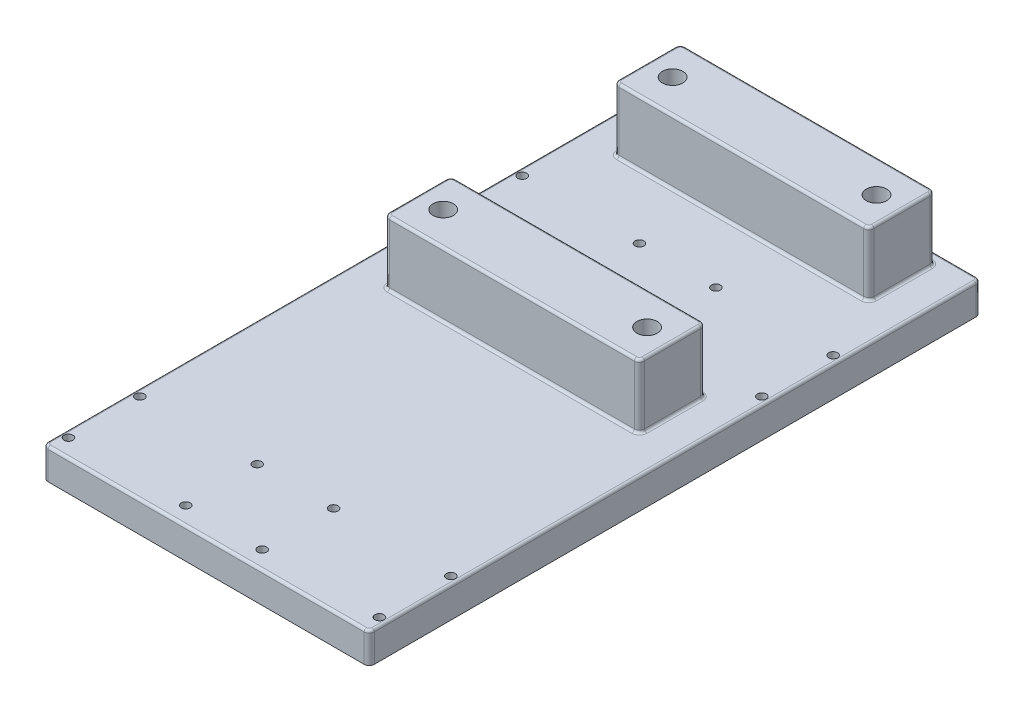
ISO-10303-21;
HEADER;
FILE_DESCRIPTION(('STEP AP214'),'2;1');
FILE_NAME('part.step','',(''),(''),'','','');
FILE_SCHEMA(('AUTOMOTIVE_DESIGN { 1 0 10303 214 1 1 1 1 }'));
ENDSEC;
DATA;
#1=APPLICATION_CONTEXT('core data for automotive mechanical design processes');
#2=APPLICATION_PROTOCOL_DEFINITION('international standard','automotive_design',2000,#1);
#3=PRODUCT_CONTEXT('',#1,'mechanical');
#4=PRODUCT('Part','Part','',(#3));
#5=PRODUCT_RELATED_PRODUCT_CATEGORY('part','',(#4));
#6=PRODUCT_DEFINITION_FORMATION('','',#4);
#7=PRODUCT_DEFINITION_CONTEXT('part definition',#1,'design');
#8=PRODUCT_DEFINITION('design','',#6,#7);
#9=PRODUCT_DEFINITION_SHAPE('','',#8);
#10=(LENGTH_UNIT() NAMED_UNIT(*) SI_UNIT(.MILLI.,.METRE.));
#11=(NAMED_UNIT(*) PLANE_ANGLE_UNIT() SI_UNIT($,.RADIAN.));
#12=(NAMED_UNIT(*) SI_UNIT($,.STERADIAN.) SOLID_ANGLE_UNIT());
#13=UNCERTAINTY_MEASURE_WITH_UNIT(LENGTH_MEASURE(1.E-05),#10,'distance_accuracy_value','');
#14=(GEOMETRIC_REPRESENTATION_CONTEXT(3) GLOBAL_UNCERTAINTY_ASSIGNED_CONTEXT((#13)) GLOBAL_UNIT_ASSIGNED_CONTEXT((#10,
#11,#12)) REPRESENTATION_CONTEXT('',''));
#15=CARTESIAN_POINT('',(0.,0.,0.));
#16=DIRECTION('',(0.,0.,1.));
#17=DIRECTION('',(1.,0.,0.));
#18=AXIS2_PLACEMENT_3D('',#15,#16,#17);
#19=CARTESIAN_POINT('',(101.6,19.05,0.));
#20=DIRECTION('',(0.,1.,0.));
#21=DIRECTION('',(0.,0.,1.));
#22=AXIS2_PLACEMENT_3D('',#19,#20,#21);
#23=PLANE('',#22);
#24=CARTESIAN_POINT('',(-76.2,19.05,9.525));
#25=DIRECTION('',(0.,1.,0.));
#26=DIRECTION('',(0.,0.,1.));
#27=AXIS2_PLACEMENT_3D('',#24,#25,#26);
#28=CIRCLE('',#27,4.7625);
#29=CARTESIAN_POINT('',(-80.9625,19.05,9.525));
#30=VERTEX_POINT('',#29);
#31=CARTESIAN_POINT('',(-76.2,19.05,4.7625));
#32=VERTEX_POINT('',#31);
#33=EDGE_CURVE('E499',#30,#32,#28,.F.);
#34=ORIENTED_EDGE('',*,*,#33,.T.);
#35=DIRECTION('',(1.,0.,0.));
#36=VECTOR('',#35,1.);
#37=CARTESIAN_POINT('',(76.2,19.05,4.76250000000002));
#38=LINE('',#37,#36);
#39=CARTESIAN_POINT('',(76.2,19.05,4.76250000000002));
#40=VERTEX_POINT('',#39);
#41=EDGE_CURVE('E503',#32,#40,#38,.T.);
#42=ORIENTED_EDGE('',*,*,#41,.T.);
#43=CARTESIAN_POINT('',(76.2,19.05,9.52500000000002));
#44=DIRECTION('',(0.,1.,0.));
#45=DIRECTION('',(0.,0.,1.));
#46=AXIS2_PLACEMENT_3D('',#43,#44,#45);
#47=CIRCLE('',#46,4.7625);
#48=CARTESIAN_POINT('',(80.9625,19.05,9.52500000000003));
#49=VERTEX_POINT('',#48);
#50=EDGE_CURVE('E501',#40,#49,#47,.F.);
#51=ORIENTED_EDGE('',*,*,#50,.T.);
#52=DIRECTION('',(0.,0.,-1.));
#53=VECTOR('',#52,1.);
#54=CARTESIAN_POINT('',(80.9625,19.05,0.));
#55=LINE('',#54,#53);
#56=CARTESIAN_POINT('',(80.9625,19.05,44.45));
#57=VERTEX_POINT('',#56);
#58=EDGE_CURVE('E497',#49,#57,#55,.F.);
#59=ORIENTED_EDGE('',*,*,#58,.T.);
#60=CARTESIAN_POINT('',(76.2,19.05,44.45));
#61=DIRECTION('',(0.,1.,0.));
#62=DIRECTION('',(0.,0.,1.));
#63=AXIS2_PLACEMENT_3D('',#60,#61,#62);
#64=CIRCLE('',#63,4.7625);
#65=CARTESIAN_POINT('',(76.2,19.05,49.2125));
#66=VERTEX_POINT('',#65);
#67=EDGE_CURVE('E493',#57,#66,#64,.F.);
#68=ORIENTED_EDGE('',*,*,#67,.T.);
#69=DIRECTION('',(-1.,0.,0.));
#70=VECTOR('',#69,1.);
#71=CARTESIAN_POINT('',(-76.2,19.05,49.2125));
#72=LINE('',#71,#70);
#73=CARTESIAN_POINT('',(-76.2,19.05,49.2125));
#74=VERTEX_POINT('',#73);
#75=EDGE_CURVE('E489',#66,#74,#72,.T.);
#76=ORIENTED_EDGE('',*,*,#75,.T.);
#77=CARTESIAN_POINT('',(-76.2,19.05,44.45));
#78=DIRECTION('',(0.,1.,0.));
#79=DIRECTION('',(0.,0.,1.));
#80=AXIS2_PLACEMENT_3D('',#77,#78,#79);
#81=CIRCLE('',#80,4.7625);
#82=CARTESIAN_POINT('',(-80.9625,19.05,44.45));
#83=VERTEX_POINT('',#82);
#84=EDGE_CURVE('E491',#74,#83,#81,.F.);
#85=ORIENTED_EDGE('',*,*,#84,.T.);
#86=DIRECTION('',(0.,0.,1.));
#87=VECTOR('',#86,1.);
#88=CARTESIAN_POINT('',(-80.9625,19.05,0.));
#89=LINE('',#88,#87);
#90=EDGE_CURVE('E495',#83,#30,#89,.F.);
#91=ORIENTED_EDGE('',*,*,#90,.T.);
#92=EDGE_LOOP('',(#34,#42,#51,#59,#68,#76,#85,#91));
#93=FACE_BOUND('',#92,.T.);
#94=CARTESIAN_POINT('',(-76.2,19.05,152.4));
#95=DIRECTION('',(0.,1.,0.));
#96=DIRECTION('',(0.,0.,1.));
#97=AXIS2_PLACEMENT_3D('',#94,#95,#96);
#98=CIRCLE('',#97,4.7625);
#99=CARTESIAN_POINT('',(-80.9625,19.05,152.4));
#100=VERTEX_POINT('',#99);
#101=CARTESIAN_POINT('',(-76.2,19.05,147.6375));
#102=VERTEX_POINT('',#101);
#103=EDGE_CURVE('E482',#100,#102,#98,.F.);
#104=ORIENTED_EDGE('',*,*,#103,.T.);
#105=DIRECTION('',(1.,0.,0.));
#106=VECTOR('',#105,1.);
#107=CARTESIAN_POINT('',(76.2,19.05,147.6375));
#108=LINE('',#107,#106);
#109=CARTESIAN_POINT('',(76.2,19.05,147.6375));
#110=VERTEX_POINT('',#109);
#111=EDGE_CURVE('E486',#102,#110,#108,.T.);
#112=ORIENTED_EDGE('',*,*,#111,.T.);
#113=CARTESIAN_POINT('',(76.2,19.05,152.4));
#114=DIRECTION('',(0.,1.,0.));
#115=DIRECTION('',(0.,0.,1.));
#116=AXIS2_PLACEMENT_3D('',#113,#114,#115);
#117=CIRCLE('',#116,4.7625);
#118=CARTESIAN_POINT('',(80.9625,19.05,152.4));
#119=VERTEX_POINT('',#118);
#120=EDGE_CURVE('E484',#110,#119,#117,.F.);
#121=ORIENTED_EDGE('',*,*,#120,.T.);
#122=DIRECTION('',(0.,0.,-1.));
#123=VECTOR('',#122,1.);
#124=CARTESIAN_POINT('',(80.9625,19.05,0.));
#125=LINE('',#124,#123);
#126=CARTESIAN_POINT('',(80.9625,19.05,187.325));
#127=VERTEX_POINT('',#126);
#128=EDGE_CURVE('E480',#119,#127,#125,.F.);
#129=ORIENTED_EDGE('',*,*,#128,.T.);
#130=CARTESIAN_POINT('',(76.2,19.05,187.325));
#131=DIRECTION('',(0.,1.,0.));
#132=DIRECTION('',(0.,0.,1.));
#133=AXIS2_PLACEMENT_3D('',#130,#131,#132);
#134=CIRCLE('',#133,4.7625);
#135=CARTESIAN_POINT('',(76.2,19.05,192.0875));
#136=VERTEX_POINT('',#135);
#137=EDGE_CURVE('E476',#127,#136,#134,.F.);
#138=ORIENTED_EDGE('',*,*,#137,.T.);
#139=DIRECTION('',(-1.,0.,0.));
#140=VECTOR('',#139,1.);
#141=CARTESIAN_POINT('',(-76.2,19.05,192.0875));
#142=LINE('',#141,#140);
#143=CARTESIAN_POINT('',(-76.2,19.05,192.0875));
#144=VERTEX_POINT('',#143);
#145=EDGE_CURVE('E472',#136,#144,#142,.T.);
#146=ORIENTED_EDGE('',*,*,#145,.T.);
#147=CARTESIAN_POINT('',(-76.2,19.05,187.325));
#148=DIRECTION('',(0.,1.,0.));
#149=DIRECTION('',(0.,0.,1.));
#150=AXIS2_PLACEMENT_3D('',#147,#148,#149);
#151=CIRCLE('',#150,4.7625);
#152=CARTESIAN_POINT('',(-80.9625,19.05,187.325));
#153=VERTEX_POINT('',#152);
#154=EDGE_CURVE('E474',#144,#153,#151,.F.);
#155=ORIENTED_EDGE('',*,*,#154,.T.);
#156=DIRECTION('',(0.,0.,1.));
#157=VECTOR('',#156,1.);
#158=CARTESIAN_POINT('',(-80.9625000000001,19.05,0.));
#159=LINE('',#158,#157);
#160=EDGE_CURVE('E478',#153,#100,#159,.F.);
#161=ORIENTED_EDGE('',*,*,#160,.T.);
#162=EDGE_LOOP('',(#104,#112,#121,#129,#138,#146,#155,#161));
#163=FACE_BOUND('',#162,.T.);
#164=CARTESIAN_POINT('',(98.425,19.05,377.825));
#165=DIRECTION('',(0.,1.,0.));
#166=DIRECTION('',(0.,0.,1.));
#167=AXIS2_PLACEMENT_3D('',#164,#165,#166);
#168=CIRCLE('',#167,1.5875);
#169=CARTESIAN_POINT('',(98.425,19.05,379.4125));
#170=VERTEX_POINT('',#169);
#171=CARTESIAN_POINT('',(100.0125,19.05,377.825));
#172=VERTEX_POINT('',#171);
#173=EDGE_CURVE('E465',#170,#172,#168,.T.);
#174=ORIENTED_EDGE('',*,*,#173,.T.);
#175=DIRECTION('',(0.,0.,1.));
#176=VECTOR('',#175,1.);
#177=CARTESIAN_POINT('',(100.0125,19.05,0.));
#178=LINE('',#177,#176);
#179=CARTESIAN_POINT('',(100.0125,19.05,3.17500000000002));
#180=VERTEX_POINT('',#179);
#181=EDGE_CURVE('E469',#172,#180,#178,.F.);
#182=ORIENTED_EDGE('',*,*,#181,.T.);
#183=CARTESIAN_POINT('',(98.425,19.05,3.17500000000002));
#184=DIRECTION('',(0.,1.,0.));
#185=DIRECTION('',(0.,0.,1.));
#186=AXIS2_PLACEMENT_3D('',#183,#184,#185);
#187=CIRCLE('',#186,1.5875);
#188=CARTESIAN_POINT('',(98.425,19.05,1.58750000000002));
#189=VERTEX_POINT('',#188);
#190=EDGE_CURVE('E467',#180,#189,#187,.T.);
#191=ORIENTED_EDGE('',*,*,#190,.T.);
#192=DIRECTION('',(1.,0.,0.));
#193=VECTOR('',#192,1.);
#194=CARTESIAN_POINT('',(101.6,19.05,1.58750000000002));
#195=LINE('',#194,#193);
#196=CARTESIAN_POINT('',(-98.425,19.05,1.5875));
#197=VERTEX_POINT('',#196);
#198=EDGE_CURVE('E463',#189,#197,#195,.F.);
#199=ORIENTED_EDGE('',*,*,#198,.T.);
#200=CARTESIAN_POINT('',(-98.425,19.05,3.175));
#201=DIRECTION('',(0.,1.,0.));
#202=DIRECTION('',(0.,0.,1.));
#203=AXIS2_PLACEMENT_3D('',#200,#201,#202);
#204=CIRCLE('',#203,1.5875);
#205=CARTESIAN_POINT('',(-100.0125,19.05,3.175));
#206=VERTEX_POINT('',#205);
#207=EDGE_CURVE('E459',#197,#206,#204,.T.);
#208=ORIENTED_EDGE('',*,*,#207,.T.);
#209=DIRECTION('',(0.,0.,1.));
#210=VECTOR('',#209,1.);
#211=CARTESIAN_POINT('',(-100.0125,19.05,377.825));
#212=LINE('',#211,#210);
#213=CARTESIAN_POINT('',(-100.0125,19.05,377.825));
#214=VERTEX_POINT('',#213);
#215=EDGE_CURVE('E455',#206,#214,#212,.T.);
#216=ORIENTED_EDGE('',*,*,#215,.T.);
#217=CARTESIAN_POINT('',(-98.425,19.05,377.825));
#218=DIRECTION('',(0.,1.,0.));
#219=DIRECTION('',(0.,0.,1.));
#220=AXIS2_PLACEMENT_3D('',#217,#218,#219);
#221=CIRCLE('',#220,1.5875);
#222=CARTESIAN_POINT('',(-98.425,19.05,379.4125));
#223=VERTEX_POINT('',#222);
#224=EDGE_CURVE('E457',#214,#223,#221,.T.);
#225=ORIENTED_EDGE('',*,*,#224,.T.);
#226=DIRECTION('',(-1.,0.,0.));
#227=VECTOR('',#226,1.);
#228=CARTESIAN_POINT('',(101.6,19.05,379.4125));
#229=LINE('',#228,#227);
#230=EDGE_CURVE('E461',#223,#170,#229,.F.);
#231=ORIENTED_EDGE('',*,*,#230,.T.);
#232=EDGE_LOOP('',(#174,#182,#191,#199,#208,#216,#225,#231));
#233=FACE_BOUND('',#232,.T.);
#234=CARTESIAN_POINT('',(23.8125,19.05,325.4375));
#235=DIRECTION('',(0.,1.,0.));
#236=DIRECTION('',(0.,0.,1.));
#237=AXIS2_PLACEMENT_3D('',#234,#235,#236);
#238=CIRCLE('',#237,2.77812499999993);
#239=CARTESIAN_POINT('',(23.8125,19.05,328.215625));
#240=VERTEX_POINT('',#239);
#241=EDGE_CURVE('E700',#240,#240,#238,.T.);
#242=ORIENTED_EDGE('',*,*,#241,.F.);
#243=EDGE_LOOP('',(#242));
#244=FACE_BOUND('',#243,.T.);
#245=CARTESIAN_POINT('',(23.8125,19.05,369.8875));
#246=DIRECTION('',(0.,1.,0.));
#247=DIRECTION('',(0.,0.,1.));
#248=AXIS2_PLACEMENT_3D('',#245,#246,#247);
#249=CIRCLE('',#248,2.77812499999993);
#250=CARTESIAN_POINT('',(23.8125,19.05,372.665625));
#251=VERTEX_POINT('',#250);
#252=EDGE_CURVE('E706',#251,#251,#249,.T.);
#253=ORIENTED_EDGE('',*,*,#252,.F.);
#254=EDGE_LOOP('',(#253));
#255=FACE_BOUND('',#254,.T.);
#256=CARTESIAN_POINT('',(-23.8125000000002,19.05,87.3124999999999));
#257=DIRECTION('',(0.,1.,0.));
#258=DIRECTION('',(0.,0.,1.));
#259=AXIS2_PLACEMENT_3D('',#256,#257,#258);
#260=CIRCLE('',#259,2.77812499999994);
#261=CARTESIAN_POINT('',(-23.8125000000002,19.05,90.0906249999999));
#262=VERTEX_POINT('',#261);
#263=EDGE_CURVE('E712',#262,#262,#260,.T.);
#264=ORIENTED_EDGE('',*,*,#263,.F.);
#265=EDGE_LOOP('',(#264));
#266=FACE_BOUND('',#265,.T.);
#267=CARTESIAN_POINT('',(-23.8125000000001,19.05,131.7625));
#268=DIRECTION('',(0.,1.,0.));
#269=DIRECTION('',(0.,0.,1.));
#270=AXIS2_PLACEMENT_3D('',#267,#268,#269);
#271=CIRCLE('',#270,2.77812499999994);
#272=CARTESIAN_POINT('',(-23.8125000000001,19.05,134.540625));
#273=VERTEX_POINT('',#272);
#274=EDGE_CURVE('E718',#273,#273,#271,.T.);
#275=ORIENTED_EDGE('',*,*,#274,.F.);
#276=EDGE_LOOP('',(#275));
#277=FACE_BOUND('',#276,.T.);
#278=CARTESIAN_POINT('',(-96.8375000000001,19.05,131.7625));
#279=DIRECTION('',(0.,1.,0.));
#280=DIRECTION('',(0.,0.,1.));
#281=AXIS2_PLACEMENT_3D('',#278,#279,#280);
#282=CIRCLE('',#281,2.77812499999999);
#283=CARTESIAN_POINT('',(-96.8375000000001,19.05,134.540625));
#284=VERTEX_POINT('',#283);
#285=EDGE_CURVE('E724',#284,#284,#282,.T.);
#286=ORIENTED_EDGE('',*,*,#285,.F.);
#287=EDGE_LOOP('',(#286));
#288=FACE_BOUND('',#287,.T.);
#289=CARTESIAN_POINT('',(-96.8375000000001,19.05,87.3124999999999));
#290=DIRECTION('',(0.,1.,0.));
#291=DIRECTION('',(0.,0.,1.));
#292=AXIS2_PLACEMENT_3D('',#289,#290,#291);
#293=CIRCLE('',#292,2.77812499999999);
#294=CARTESIAN_POINT('',(-96.8375000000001,19.05,90.0906249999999));
#295=VERTEX_POINT('',#294);
#296=EDGE_CURVE('E730',#295,#295,#293,.T.);
#297=ORIENTED_EDGE('',*,*,#296,.F.);
#298=EDGE_LOOP('',(#297));
#299=FACE_BOUND('',#298,.T.);
#300=CARTESIAN_POINT('',(-23.8125000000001,19.05,325.4375));
#301=DIRECTION('',(0.,1.,0.));
#302=DIRECTION('',(0.,0.,1.));
#303=AXIS2_PLACEMENT_3D('',#300,#301,#302);
#304=CIRCLE('',#303,2.77812499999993);
#305=CARTESIAN_POINT('',(-23.8125000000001,19.05,328.215625));
#306=VERTEX_POINT('',#305);
#307=EDGE_CURVE('E736',#306,#306,#304,.T.);
#308=ORIENTED_EDGE('',*,*,#307,.F.);
#309=EDGE_LOOP('',(#308));
#310=FACE_BOUND('',#309,.T.);
#311=CARTESIAN_POINT('',(-23.8125,19.05,369.8875));
#312=DIRECTION('',(0.,1.,0.));
#313=DIRECTION('',(0.,0.,1.));
#314=AXIS2_PLACEMENT_3D('',#311,#312,#313);
#315=CIRCLE('',#314,2.77812499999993);
#316=CARTESIAN_POINT('',(-23.8125,19.05,372.665625));
#317=VERTEX_POINT('',#316);
#318=EDGE_CURVE('E742',#317,#317,#315,.T.);
#319=ORIENTED_EDGE('',*,*,#318,.F.);
#320=EDGE_LOOP('',(#319));
#321=FACE_BOUND('',#320,.T.);
#322=CARTESIAN_POINT('',(-96.8375,19.05,369.8875));
#323=DIRECTION('',(0.,1.,0.));
#324=DIRECTION('',(0.,0.,1.));
#325=AXIS2_PLACEMENT_3D('',#322,#323,#324);
#326=CIRCLE('',#325,2.77812499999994);
#327=CARTESIAN_POINT('',(-96.8375,19.05,372.665625));
#328=VERTEX_POINT('',#327);
#329=EDGE_CURVE('E748',#328,#328,#326,.T.);
#330=ORIENTED_EDGE('',*,*,#329,.F.);
#331=EDGE_LOOP('',(#330));
#332=FACE_BOUND('',#331,.T.);
#333=CARTESIAN_POINT('',(-96.8375,19.05,325.4375));
#334=DIRECTION('',(0.,1.,0.));
#335=DIRECTION('',(0.,0.,1.));
#336=AXIS2_PLACEMENT_3D('',#333,#334,#335);
#337=CIRCLE('',#336,2.77812499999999);
#338=CARTESIAN_POINT('',(-96.8375,19.05,328.215625));
#339=VERTEX_POINT('',#338);
#340=EDGE_CURVE('E754',#339,#339,#337,.T.);
#341=ORIENTED_EDGE('',*,*,#340,.F.);
#342=EDGE_LOOP('',(#341));
#343=FACE_BOUND('',#342,.T.);
#344=CARTESIAN_POINT('',(23.8125,19.05,131.7625));
#345=DIRECTION('',(0.,1.,0.));
#346=DIRECTION('',(0.,0.,1.));
#347=AXIS2_PLACEMENT_3D('',#344,#345,#346);
#348=CIRCLE('',#347,2.77812499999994);
#349=CARTESIAN_POINT('',(23.8125,19.05,134.540625));
#350=VERTEX_POINT('',#349);
#351=EDGE_CURVE('E760',#350,#350,#348,.T.);
#352=ORIENTED_EDGE('',*,*,#351,.F.);
#353=EDGE_LOOP('',(#352));
#354=FACE_BOUND('',#353,.T.);
#355=CARTESIAN_POINT('',(23.8125,19.05,87.3125));
#356=DIRECTION('',(0.,1.,0.));
#357=DIRECTION('',(0.,0.,1.));
#358=AXIS2_PLACEMENT_3D('',#355,#356,#357);
#359=CIRCLE('',#358,2.77812499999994);
#360=CARTESIAN_POINT('',(23.8125,19.05,90.0906249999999));
#361=VERTEX_POINT('',#360);
#362=EDGE_CURVE('E766',#361,#361,#359,.T.);
#363=ORIENTED_EDGE('',*,*,#362,.F.);
#364=EDGE_LOOP('',(#363));
#365=FACE_BOUND('',#364,.T.);
#366=CARTESIAN_POINT('',(96.8374999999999,19.05,325.4375));
#367=DIRECTION('',(0.,1.,0.));
#368=DIRECTION('',(0.,0.,1.));
#369=AXIS2_PLACEMENT_3D('',#366,#367,#368);
#370=CIRCLE('',#369,2.77812499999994);
#371=CARTESIAN_POINT('',(96.8374999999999,19.05,328.215625));
#372=VERTEX_POINT('',#371);
#373=EDGE_CURVE('E772',#372,#372,#370,.T.);
#374=ORIENTED_EDGE('',*,*,#373,.F.);
#375=EDGE_LOOP('',(#374));
#376=FACE_BOUND('',#375,.T.);
#377=CARTESIAN_POINT('',(96.8375,19.05,369.8875));
#378=DIRECTION('',(0.,1.,0.));
#379=DIRECTION('',(0.,0.,1.));
#380=AXIS2_PLACEMENT_3D('',#377,#378,#379);
#381=CIRCLE('',#380,2.77812499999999);
#382=CARTESIAN_POINT('',(96.8375,19.05,372.665625));
#383=VERTEX_POINT('',#382);
#384=EDGE_CURVE('E778',#383,#383,#381,.T.);
#385=ORIENTED_EDGE('',*,*,#384,.F.);
#386=EDGE_LOOP('',(#385));
#387=FACE_BOUND('',#386,.T.);
#388=CARTESIAN_POINT('',(96.8374999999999,19.05,131.7625));
#389=DIRECTION('',(0.,1.,0.));
#390=DIRECTION('',(0.,0.,1.));
#391=AXIS2_PLACEMENT_3D('',#388,#389,#390);
#392=CIRCLE('',#391,2.778125);
#393=CARTESIAN_POINT('',(96.8374999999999,19.05,134.540625));
#394=VERTEX_POINT('',#393);
#395=EDGE_CURVE('E784',#394,#394,#392,.T.);
#396=ORIENTED_EDGE('',*,*,#395,.F.);
#397=EDGE_LOOP('',(#396));
#398=FACE_BOUND('',#397,.T.);
#399=CARTESIAN_POINT('',(96.8375,19.05,87.3125000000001));
#400=DIRECTION('',(0.,1.,0.));
#401=DIRECTION('',(0.,0.,1.));
#402=AXIS2_PLACEMENT_3D('',#399,#400,#401);
#403=CIRCLE('',#402,2.778125);
#404=CARTESIAN_POINT('',(96.8375,19.05,90.0906250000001));
#405=VERTEX_POINT('',#404);
#406=EDGE_CURVE('E790',#405,#405,#403,.T.);
#407=ORIENTED_EDGE('',*,*,#406,.F.);
#408=EDGE_LOOP('',(#407));
#409=FACE_BOUND('',#408,.T.);
#410=ADVANCED_FACE('F31',(#93,#163,#233,#244,#255,#266,#277,#288,#299,#310,#321,#332,#343,#354,
#365,#376,#387,#398,#409),#23,.T.);
#411=CARTESIAN_POINT('',(-79.375,58.7375,6.34999999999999));
#412=DIRECTION('',(0.,1.,0.));
#413=DIRECTION('',(0.,0.,1.));
#414=AXIS2_PLACEMENT_3D('',#411,#412,#413);
#415=PLANE('',#414);
#416=CARTESIAN_POINT('',(76.2,58.7375,9.52500000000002));
#417=DIRECTION('',(0.,1.,0.));
#418=DIRECTION('',(0.,0.,1.));
#419=AXIS2_PLACEMENT_3D('',#416,#417,#418);
#420=CIRCLE('',#419,1.5875);
#421=CARTESIAN_POINT('',(77.7875,58.7375,9.52500000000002));
#422=VERTEX_POINT('',#421);
#423=CARTESIAN_POINT('',(76.2,58.7375,7.93750000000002));
#424=VERTEX_POINT('',#423);
#425=EDGE_CURVE('E450',#422,#424,#420,.T.);
#426=ORIENTED_EDGE('',*,*,#425,.T.);
#427=DIRECTION('',(1.,0.,0.));
#428=VECTOR('',#427,1.);
#429=CARTESIAN_POINT('',(-79.375,58.7375,7.93749999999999));
#430=LINE('',#429,#428);
#431=CARTESIAN_POINT('',(-76.2,58.7375,7.93749999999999));
#432=VERTEX_POINT('',#431);
#433=EDGE_CURVE('E452',#424,#432,#430,.F.);
#434=ORIENTED_EDGE('',*,*,#433,.T.);
#435=CARTESIAN_POINT('',(-76.2,58.7375,9.525));
#436=DIRECTION('',(0.,1.,0.));
#437=DIRECTION('',(0.,0.,1.));
#438=AXIS2_PLACEMENT_3D('',#435,#436,#437);
#439=CIRCLE('',#438,1.5875);
#440=CARTESIAN_POINT('',(-77.7875,58.7375,9.525));
#441=VERTEX_POINT('',#440);
#442=EDGE_CURVE('E448',#432,#441,#439,.T.);
#443=ORIENTED_EDGE('',*,*,#442,.T.);
#444=DIRECTION('',(0.,0.,1.));
#445=VECTOR('',#444,1.);
#446=CARTESIAN_POINT('',(-77.7875,58.7375,44.45));
#447=LINE('',#446,#445);
#448=CARTESIAN_POINT('',(-77.7875,58.7375,44.45));
#449=VERTEX_POINT('',#448);
#450=EDGE_CURVE('E444',#441,#449,#447,.T.);
#451=ORIENTED_EDGE('',*,*,#450,.T.);
#452=CARTESIAN_POINT('',(-76.2,58.7375,44.45));
#453=DIRECTION('',(0.,1.,0.));
#454=DIRECTION('',(0.,0.,1.));
#455=AXIS2_PLACEMENT_3D('',#452,#453,#454);
#456=CIRCLE('',#455,1.5875);
#457=CARTESIAN_POINT('',(-76.2,58.7375,46.0375));
#458=VERTEX_POINT('',#457);
#459=EDGE_CURVE('E440',#449,#458,#456,.T.);
#460=ORIENTED_EDGE('',*,*,#459,.T.);
#461=DIRECTION('',(-1.,0.,0.));
#462=VECTOR('',#461,1.);
#463=CARTESIAN_POINT('',(-79.375,58.7375,46.0375));
#464=LINE('',#463,#462);
#465=CARTESIAN_POINT('',(76.2,58.7375,46.0375));
#466=VERTEX_POINT('',#465);
#467=EDGE_CURVE('E438',#458,#466,#464,.F.);
#468=ORIENTED_EDGE('',*,*,#467,.T.);
#469=CARTESIAN_POINT('',(76.2,58.7375,44.45));
#470=DIRECTION('',(0.,1.,0.));
#471=DIRECTION('',(0.,0.,1.));
#472=AXIS2_PLACEMENT_3D('',#469,#470,#471);
#473=CIRCLE('',#472,1.5875);
#474=CARTESIAN_POINT('',(77.7875,58.7375,44.45));
#475=VERTEX_POINT('',#474);
#476=EDGE_CURVE('E442',#466,#475,#473,.T.);
#477=ORIENTED_EDGE('',*,*,#476,.T.);
#478=DIRECTION('',(0.,0.,-1.));
#479=VECTOR('',#478,1.);
#480=CARTESIAN_POINT('',(77.7875,58.7375,9.52500000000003));
#481=LINE('',#480,#479);
#482=EDGE_CURVE('E446',#475,#422,#481,.T.);
#483=ORIENTED_EDGE('',*,*,#482,.T.);
#484=EDGE_LOOP('',(#426,#434,#443,#451,#460,#468,#477,#483));
#485=FACE_BOUND('',#484,.T.);
#486=CARTESIAN_POINT('',(63.5,58.7375,26.9875));
#487=DIRECTION('',(0.,1.,0.));
#488=DIRECTION('',(0.,0.,1.));
#489=AXIS2_PLACEMENT_3D('',#486,#487,#488);
#490=CIRCLE('',#489,6.35);
#491=CARTESIAN_POINT('',(63.5,58.7375,33.3375));
#492=VERTEX_POINT('',#491);
#493=EDGE_CURVE('E811',#492,#492,#490,.T.);
#494=ORIENTED_EDGE('',*,*,#493,.F.);
#495=EDGE_LOOP('',(#494));
#496=FACE_BOUND('',#495,.T.);
#497=CARTESIAN_POINT('',(-63.5,58.7375,26.9875));
#498=DIRECTION('',(0.,-1.,0.));
#499=DIRECTION('',(0.,0.,-1.));
#500=AXIS2_PLACEMENT_3D('',#497,#498,#499);
#501=CIRCLE('',#500,6.35000000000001);
#502=CARTESIAN_POINT('',(-63.5,58.7375,33.3375));
#503=VERTEX_POINT('',#502);
#504=EDGE_CURVE('E805',#503,#503,#501,.T.);
#505=ORIENTED_EDGE('',*,*,#504,.T.);
#506=EDGE_LOOP('',(#505));
#507=FACE_BOUND('',#506,.T.);
#508=ADVANCED_FACE('F995',(#485,#496,#507),#415,.T.);
#509=CARTESIAN_POINT('',(101.6,19.05,0.));
#510=DIRECTION('',(1.,0.,0.));
#511=DIRECTION('',(0.,0.,-1.));
#512=AXIS2_PLACEMENT_3D('',#509,#510,#511);
#513=PLANE('',#512);
#514=DIRECTION('',(0.,-1.,0.));
#515=VECTOR('',#514,1.);
#516=CARTESIAN_POINT('',(101.6,19.05,3.17500000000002));
#517=LINE('',#516,#515);
#518=CARTESIAN_POINT('',(101.6,0.,3.17500000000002));
#519=VERTEX_POINT('',#518);
#520=CARTESIAN_POINT('',(101.6,17.4625,3.17500000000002));
#521=VERTEX_POINT('',#520);
#522=EDGE_CURVE('E352',#519,#521,#517,.F.);
#523=ORIENTED_EDGE('',*,*,#522,.T.);
#524=DIRECTION('',(0.,0.,1.));
#525=VECTOR('',#524,1.);
#526=CARTESIAN_POINT('',(101.6,17.4625,0.));
#527=LINE('',#526,#525);
#528=CARTESIAN_POINT('',(101.6,17.4625,377.825));
#529=VERTEX_POINT('',#528);
#530=EDGE_CURVE('E511',#521,#529,#527,.T.);
#531=ORIENTED_EDGE('',*,*,#530,.T.);
#532=DIRECTION('',(0.,-1.,0.));
#533=VECTOR('',#532,1.);
#534=CARTESIAN_POINT('',(101.6,19.05,377.825));
#535=LINE('',#534,#533);
#536=CARTESIAN_POINT('',(101.6,0.,377.825));
#537=VERTEX_POINT('',#536);
#538=EDGE_CURVE('E355',#529,#537,#535,.T.);
#539=ORIENTED_EDGE('',*,*,#538,.T.);
#540=DIRECTION('',(0.,0.,1.));
#541=VECTOR('',#540,1.);
#542=CARTESIAN_POINT('',(101.6,0.,0.));
#543=LINE('',#542,#541);
#544=EDGE_CURVE('E318',#519,#537,#543,.T.);
#545=ORIENTED_EDGE('',*,*,#544,.F.);
#546=EDGE_LOOP('',(#523,#531,#539,#545));
#547=FACE_BOUND('',#546,.T.);
#548=ADVANCED_FACE('F33',(#547),#513,.T.);
#549=CARTESIAN_POINT('',(-101.6,19.05,0.));
#550=DIRECTION('',(0.,0.,-1.));
#551=DIRECTION('',(-1.,0.,0.));
#552=AXIS2_PLACEMENT_3D('',#549,#550,#551);
#553=PLANE('',#552);
#554=DIRECTION('',(0.,-1.,0.));
#555=VECTOR('',#554,1.);
#556=CARTESIAN_POINT('',(-98.425,19.05,0.));
#557=LINE('',#556,#555);
#558=CARTESIAN_POINT('',(-98.425,0.,0.));
#559=VERTEX_POINT('',#558);
#560=CARTESIAN_POINT('',(-98.425,17.4625,0.));
#561=VERTEX_POINT('',#560);
#562=EDGE_CURVE('E357',#559,#561,#557,.F.);
#563=ORIENTED_EDGE('',*,*,#562,.T.);
#564=DIRECTION('',(1.,0.,0.));
#565=VECTOR('',#564,1.);
#566=CARTESIAN_POINT('',(-101.6,17.4625,0.));
#567=LINE('',#566,#565);
#568=CARTESIAN_POINT('',(98.425,17.4625,0.));
#569=VERTEX_POINT('',#568);
#570=EDGE_CURVE('E557',#561,#569,#567,.T.);
#571=ORIENTED_EDGE('',*,*,#570,.T.);
#572=DIRECTION('',(0.,-1.,0.));
#573=VECTOR('',#572,1.);
#574=CARTESIAN_POINT('',(98.425,19.05,0.));
#575=LINE('',#574,#573);
#576=CARTESIAN_POINT('',(98.425,0.,0.));
#577=VERTEX_POINT('',#576);
#578=EDGE_CURVE('E360',#569,#577,#575,.T.);
#579=ORIENTED_EDGE('',*,*,#578,.T.);
#580=DIRECTION('',(1.,0.,0.));
#581=VECTOR('',#580,1.);
#582=CARTESIAN_POINT('',(-101.6,0.,0.));
#583=LINE('',#582,#581);
#584=EDGE_CURVE('E337',#559,#577,#583,.T.);
#585=ORIENTED_EDGE('',*,*,#584,.F.);
#586=EDGE_LOOP('',(#563,#571,#579,#585));
#587=FACE_BOUND('',#586,.T.);
#588=ADVANCED_FACE('F1006',(#587),#553,.T.);
#589=CARTESIAN_POINT('',(-101.6,19.05,0.));
#590=DIRECTION('',(1.,0.,0.));
#591=DIRECTION('',(0.,0.,-1.));
#592=AXIS2_PLACEMENT_3D('',#589,#590,#591);
#593=PLANE('',#592);
#594=DIRECTION('',(0.,-1.,0.));
#595=VECTOR('',#594,1.);
#596=CARTESIAN_POINT('',(-101.6,19.05,377.825));
#597=LINE('',#596,#595);
#598=CARTESIAN_POINT('',(-101.6,0.,377.825));
#599=VERTEX_POINT('',#598);
#600=CARTESIAN_POINT('',(-101.6,17.4625,377.825));
#601=VERTEX_POINT('',#600);
#602=EDGE_CURVE('E350',#599,#601,#597,.F.);
#603=ORIENTED_EDGE('',*,*,#602,.T.);
#604=DIRECTION('',(0.,0.,1.));
#605=VECTOR('',#604,1.);
#606=CARTESIAN_POINT('',(-101.6,17.4625,3.175));
#607=LINE('',#606,#605);
#608=CARTESIAN_POINT('',(-101.6,17.4625,3.175));
#609=VERTEX_POINT('',#608);
#610=EDGE_CURVE('E11',#601,#609,#607,.F.);
#611=ORIENTED_EDGE('',*,*,#610,.T.);
#612=DIRECTION('',(0.,-1.,0.));
#613=VECTOR('',#612,1.);
#614=CARTESIAN_POINT('',(-101.6,0.,3.175));
#615=LINE('',#614,#613);
#616=CARTESIAN_POINT('',(-101.6,0.,3.175));
#617=VERTEX_POINT('',#616);
#618=EDGE_CURVE('E348',#609,#617,#615,.T.);
#619=ORIENTED_EDGE('',*,*,#618,.T.);
#620=DIRECTION('',(0.,0.,1.));
#621=VECTOR('',#620,1.);
#622=CARTESIAN_POINT('',(-101.6,0.,0.));
#623=LINE('',#622,#621);
#624=EDGE_CURVE('E332',#617,#599,#623,.T.);
#625=ORIENTED_EDGE('',*,*,#624,.T.);
#626=EDGE_LOOP('',(#603,#611,#619,#625));
#627=FACE_BOUND('',#626,.T.);
#628=ADVANCED_FACE('F819',(#627),#593,.F.);
#629=CARTESIAN_POINT('',(101.6,19.05,381.));
#630=DIRECTION('',(0.,0.,1.));
#631=DIRECTION('',(1.,0.,0.));
#632=AXIS2_PLACEMENT_3D('',#629,#630,#631);
#633=PLANE('',#632);
#634=DIRECTION('',(0.,-1.,0.));
#635=VECTOR('',#634,1.);
#636=CARTESIAN_POINT('',(98.425,19.05,381.));
#637=LINE('',#636,#635);
#638=CARTESIAN_POINT('',(98.425,0.,381.));
#639=VERTEX_POINT('',#638);
#640=CARTESIAN_POINT('',(98.425,17.4625,381.));
#641=VERTEX_POINT('',#640);
#642=EDGE_CURVE('E328',#639,#641,#637,.F.);
#643=ORIENTED_EDGE('',*,*,#642,.T.);
#644=DIRECTION('',(-1.,0.,0.));
#645=VECTOR('',#644,1.);
#646=CARTESIAN_POINT('',(101.6,17.4625,381.));
#647=LINE('',#646,#645);
#648=CARTESIAN_POINT('',(-98.425,17.4625,381.));
#649=VERTEX_POINT('',#648);
#650=EDGE_CURVE('E559',#641,#649,#647,.T.);
#651=ORIENTED_EDGE('',*,*,#650,.T.);
#652=DIRECTION('',(0.,-1.,0.));
#653=VECTOR('',#652,1.);
#654=CARTESIAN_POINT('',(-98.425,0.,381.));
#655=LINE('',#654,#653);
#656=CARTESIAN_POINT('',(-98.425,0.,381.));
#657=VERTEX_POINT('',#656);
#658=EDGE_CURVE('E330',#649,#657,#655,.T.);
#659=ORIENTED_EDGE('',*,*,#658,.T.);
#660=DIRECTION('',(-1.,0.,0.));
#661=VECTOR('',#660,1.);
#662=CARTESIAN_POINT('',(101.6,0.,381.));
#663=LINE('',#662,#661);
#664=EDGE_CURVE('E316',#639,#657,#663,.T.);
#665=ORIENTED_EDGE('',*,*,#664,.F.);
#666=EDGE_LOOP('',(#643,#651,#659,#665));
#667=FACE_BOUND('',#666,.T.);
#668=ADVANCED_FACE('F327',(#667),#633,.T.);
#669=CARTESIAN_POINT('',(101.6,0.,0.));
#670=DIRECTION('',(0.,1.,0.));
#671=DIRECTION('',(0.,0.,1.));
#672=AXIS2_PLACEMENT_3D('',#669,#670,#671);
#673=PLANE('',#672);
#674=CARTESIAN_POINT('',(23.8125,0.,325.4375));
#675=DIRECTION('',(0.,-1.,0.));
#676=DIRECTION('',(0.,0.,-1.));
#677=AXIS2_PLACEMENT_3D('',#674,#675,#676);
#678=CIRCLE('',#677,2.77812499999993);
#679=CARTESIAN_POINT('',(23.8125,0.,322.659375));
#680=VERTEX_POINT('',#679);
#681=EDGE_CURVE('E697',#680,#680,#678,.T.);
#682=ORIENTED_EDGE('',*,*,#681,.F.);
#683=EDGE_LOOP('',(#682));
#684=FACE_BOUND('',#683,.T.);
#685=CARTESIAN_POINT('',(23.8125,0.,369.8875));
#686=DIRECTION('',(0.,-1.,0.));
#687=DIRECTION('',(0.,0.,-1.));
#688=AXIS2_PLACEMENT_3D('',#685,#686,#687);
#689=CIRCLE('',#688,2.77812499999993);
#690=CARTESIAN_POINT('',(23.8125,0.,367.109375));
#691=VERTEX_POINT('',#690);
#692=EDGE_CURVE('E703',#691,#691,#689,.T.);
#693=ORIENTED_EDGE('',*,*,#692,.F.);
#694=EDGE_LOOP('',(#693));
#695=FACE_BOUND('',#694,.T.);
#696=CARTESIAN_POINT('',(-23.8125000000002,0.,87.3124999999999));
#697=DIRECTION('',(0.,-1.,0.));
#698=DIRECTION('',(0.,0.,-1.));
#699=AXIS2_PLACEMENT_3D('',#696,#697,#698);
#700=CIRCLE('',#699,2.77812499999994);
#701=CARTESIAN_POINT('',(-23.8125000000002,0.,84.534375));
#702=VERTEX_POINT('',#701);
#703=EDGE_CURVE('E709',#702,#702,#700,.T.);
#704=ORIENTED_EDGE('',*,*,#703,.F.);
#705=EDGE_LOOP('',(#704));
#706=FACE_BOUND('',#705,.T.);
#707=CARTESIAN_POINT('',(-23.8125000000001,0.,131.7625));
#708=DIRECTION('',(0.,-1.,0.));
#709=DIRECTION('',(0.,0.,-1.));
#710=AXIS2_PLACEMENT_3D('',#707,#708,#709);
#711=CIRCLE('',#710,2.77812499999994);
#712=CARTESIAN_POINT('',(-23.8125000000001,0.,128.984375));
#713=VERTEX_POINT('',#712);
#714=EDGE_CURVE('E715',#713,#713,#711,.T.);
#715=ORIENTED_EDGE('',*,*,#714,.F.);
#716=EDGE_LOOP('',(#715));
#717=FACE_BOUND('',#716,.T.);
#718=CARTESIAN_POINT('',(-96.8375000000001,0.,131.7625));
#719=DIRECTION('',(0.,-1.,0.));
#720=DIRECTION('',(0.,0.,-1.));
#721=AXIS2_PLACEMENT_3D('',#718,#719,#720);
#722=CIRCLE('',#721,2.77812499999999);
#723=CARTESIAN_POINT('',(-96.8375000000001,0.,128.984375));
#724=VERTEX_POINT('',#723);
#725=EDGE_CURVE('E721',#724,#724,#722,.T.);
#726=ORIENTED_EDGE('',*,*,#725,.F.);
#727=EDGE_LOOP('',(#726));
#728=FACE_BOUND('',#727,.T.);
#729=CARTESIAN_POINT('',(-96.8375000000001,0.,87.3124999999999));
#730=DIRECTION('',(0.,-1.,0.));
#731=DIRECTION('',(0.,0.,-1.));
#732=AXIS2_PLACEMENT_3D('',#729,#730,#731);
#733=CIRCLE('',#732,2.77812499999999);
#734=CARTESIAN_POINT('',(-96.8375000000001,0.,84.5343749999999));
#735=VERTEX_POINT('',#734);
#736=EDGE_CURVE('E727',#735,#735,#733,.T.);
#737=ORIENTED_EDGE('',*,*,#736,.F.);
#738=EDGE_LOOP('',(#737));
#739=FACE_BOUND('',#738,.T.);
#740=CARTESIAN_POINT('',(-23.8125000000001,0.,325.4375));
#741=DIRECTION('',(0.,-1.,0.));
#742=DIRECTION('',(0.,0.,-1.));
#743=AXIS2_PLACEMENT_3D('',#740,#741,#742);
#744=CIRCLE('',#743,2.77812499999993);
#745=CARTESIAN_POINT('',(-23.8125000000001,0.,322.659375));
#746=VERTEX_POINT('',#745);
#747=EDGE_CURVE('E733',#746,#746,#744,.T.);
#748=ORIENTED_EDGE('',*,*,#747,.F.);
#749=EDGE_LOOP('',(#748));
#750=FACE_BOUND('',#749,.T.);
#751=CARTESIAN_POINT('',(-23.8125,0.,369.8875));
#752=DIRECTION('',(0.,-1.,0.));
#753=DIRECTION('',(0.,0.,-1.));
#754=AXIS2_PLACEMENT_3D('',#751,#752,#753);
#755=CIRCLE('',#754,2.77812499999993);
#756=CARTESIAN_POINT('',(-23.8125,0.,367.109375));
#757=VERTEX_POINT('',#756);
#758=EDGE_CURVE('E739',#757,#757,#755,.T.);
#759=ORIENTED_EDGE('',*,*,#758,.F.);
#760=EDGE_LOOP('',(#759));
#761=FACE_BOUND('',#760,.T.);
#762=CARTESIAN_POINT('',(-96.8375,0.,369.8875));
#763=DIRECTION('',(0.,-1.,0.));
#764=DIRECTION('',(0.,0.,-1.));
#765=AXIS2_PLACEMENT_3D('',#762,#763,#764);
#766=CIRCLE('',#765,2.77812499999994);
#767=CARTESIAN_POINT('',(-96.8375,0.,367.109375));
#768=VERTEX_POINT('',#767);
#769=EDGE_CURVE('E745',#768,#768,#766,.T.);
#770=ORIENTED_EDGE('',*,*,#769,.F.);
#771=EDGE_LOOP('',(#770));
#772=FACE_BOUND('',#771,.T.);
#773=CARTESIAN_POINT('',(-96.8375,0.,325.4375));
#774=DIRECTION('',(0.,-1.,0.));
#775=DIRECTION('',(0.,0.,-1.));
#776=AXIS2_PLACEMENT_3D('',#773,#774,#775);
#777=CIRCLE('',#776,2.77812499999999);
#778=CARTESIAN_POINT('',(-96.8375,0.,322.659375));
#779=VERTEX_POINT('',#778);
#780=EDGE_CURVE('E751',#779,#779,#777,.T.);
#781=ORIENTED_EDGE('',*,*,#780,.F.);
#782=EDGE_LOOP('',(#781));
#783=FACE_BOUND('',#782,.T.);
#784=CARTESIAN_POINT('',(23.8125,0.,131.7625));
#785=DIRECTION('',(0.,-1.,0.));
#786=DIRECTION('',(0.,0.,-1.));
#787=AXIS2_PLACEMENT_3D('',#784,#785,#786);
#788=CIRCLE('',#787,2.77812499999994);
#789=CARTESIAN_POINT('',(23.8125,0.,128.984375));
#790=VERTEX_POINT('',#789);
#791=EDGE_CURVE('E757',#790,#790,#788,.T.);
#792=ORIENTED_EDGE('',*,*,#791,.F.);
#793=EDGE_LOOP('',(#792));
#794=FACE_BOUND('',#793,.T.);
#795=CARTESIAN_POINT('',(23.8125,0.,87.3125));
#796=DIRECTION('',(0.,-1.,0.));
#797=DIRECTION('',(0.,0.,-1.));
#798=AXIS2_PLACEMENT_3D('',#795,#796,#797);
#799=CIRCLE('',#798,2.77812499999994);
#800=CARTESIAN_POINT('',(23.8125,0.,84.534375));
#801=VERTEX_POINT('',#800);
#802=EDGE_CURVE('E763',#801,#801,#799,.T.);
#803=ORIENTED_EDGE('',*,*,#802,.F.);
#804=EDGE_LOOP('',(#803));
#805=FACE_BOUND('',#804,.T.);
#806=CARTESIAN_POINT('',(96.8374999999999,0.,325.4375));
#807=DIRECTION('',(0.,-1.,0.));
#808=DIRECTION('',(0.,0.,-1.));
#809=AXIS2_PLACEMENT_3D('',#806,#807,#808);
#810=CIRCLE('',#809,2.77812499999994);
#811=CARTESIAN_POINT('',(96.8374999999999,0.,322.659375));
#812=VERTEX_POINT('',#811);
#813=EDGE_CURVE('E769',#812,#812,#810,.T.);
#814=ORIENTED_EDGE('',*,*,#813,.F.);
#815=EDGE_LOOP('',(#814));
#816=FACE_BOUND('',#815,.T.);
#817=CARTESIAN_POINT('',(96.8375,0.,369.8875));
#818=DIRECTION('',(0.,-1.,0.));
#819=DIRECTION('',(0.,0.,-1.));
#820=AXIS2_PLACEMENT_3D('',#817,#818,#819);
#821=CIRCLE('',#820,2.77812499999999);
#822=CARTESIAN_POINT('',(96.8375,0.,367.109375));
#823=VERTEX_POINT('',#822);
#824=EDGE_CURVE('E775',#823,#823,#821,.T.);
#825=ORIENTED_EDGE('',*,*,#824,.F.);
#826=EDGE_LOOP('',(#825));
#827=FACE_BOUND('',#826,.T.);
#828=CARTESIAN_POINT('',(96.8374999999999,0.,131.7625));
#829=DIRECTION('',(0.,-1.,0.));
#830=DIRECTION('',(0.,0.,-1.));
#831=AXIS2_PLACEMENT_3D('',#828,#829,#830);
#832=CIRCLE('',#831,2.778125);
#833=CARTESIAN_POINT('',(96.8374999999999,0.,128.984375));
#834=VERTEX_POINT('',#833);
#835=EDGE_CURVE('E781',#834,#834,#832,.T.);
#836=ORIENTED_EDGE('',*,*,#835,.F.);
#837=EDGE_LOOP('',(#836));
#838=FACE_BOUND('',#837,.T.);
#839=CARTESIAN_POINT('',(96.8375,0.,87.3125000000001));
#840=DIRECTION('',(0.,-1.,0.));
#841=DIRECTION('',(0.,0.,-1.));
#842=AXIS2_PLACEMENT_3D('',#839,#840,#841);
#843=CIRCLE('',#842,2.778125);
#844=CARTESIAN_POINT('',(96.8375,0.,84.5343750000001));
#845=VERTEX_POINT('',#844);
#846=EDGE_CURVE('E787',#845,#845,#843,.T.);
#847=ORIENTED_EDGE('',*,*,#846,.F.);
#848=EDGE_LOOP('',(#847));
#849=FACE_BOUND('',#848,.T.);
#850=ORIENTED_EDGE('',*,*,#664,.T.);
#851=CARTESIAN_POINT('',(-98.425,0.,377.825));
#852=DIRECTION('',(0.,1.,0.));
#853=DIRECTION('',(0.,0.,1.));
#854=AXIS2_PLACEMENT_3D('',#851,#852,#853);
#855=CIRCLE('',#854,3.175);
#856=EDGE_CURVE('E322',#657,#599,#855,.F.);
#857=ORIENTED_EDGE('',*,*,#856,.T.);
#858=ORIENTED_EDGE('',*,*,#624,.F.);
#859=CARTESIAN_POINT('',(-98.425,0.,3.175));
#860=DIRECTION('',(0.,1.,0.));
#861=DIRECTION('',(0.,0.,1.));
#862=AXIS2_PLACEMENT_3D('',#859,#860,#861);
#863=CIRCLE('',#862,3.175);
#864=EDGE_CURVE('E339',#617,#559,#863,.F.);
#865=ORIENTED_EDGE('',*,*,#864,.T.);
#866=ORIENTED_EDGE('',*,*,#584,.T.);
#867=CARTESIAN_POINT('',(98.425,0.,3.17500000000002));
#868=DIRECTION('',(0.,1.,0.));
#869=DIRECTION('',(0.,0.,1.));
#870=AXIS2_PLACEMENT_3D('',#867,#868,#869);
#871=CIRCLE('',#870,3.175);
#872=EDGE_CURVE('E323',#577,#519,#871,.F.);
#873=ORIENTED_EDGE('',*,*,#872,.T.);
#874=ORIENTED_EDGE('',*,*,#544,.T.);
#875=CARTESIAN_POINT('',(98.425,0.,377.825));
#876=DIRECTION('',(0.,1.,0.));
#877=DIRECTION('',(0.,0.,1.));
#878=AXIS2_PLACEMENT_3D('',#875,#876,#877);
#879=CIRCLE('',#878,3.175);
#880=EDGE_CURVE('E313',#537,#639,#879,.F.);
#881=ORIENTED_EDGE('',*,*,#880,.T.);
#882=EDGE_LOOP('',(#850,#857,#858,#865,#866,#873,#874,#881));
#883=FACE_BOUND('',#882,.T.);
#884=ADVANCED_FACE('F315',(#684,#695,#706,#717,#728,#739,#750,#761,#772,#783,#794,#805,#816,
#827,#838,#849,#883),#673,.F.);
#885=CARTESIAN_POINT('',(-79.375,58.7375,6.34999999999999));
#886=DIRECTION('',(1.,0.,0.));
#887=DIRECTION('',(0.,0.,-1.));
#888=AXIS2_PLACEMENT_3D('',#885,#886,#887);
#889=PLANE('',#888);
#890=DIRECTION('',(0.,-1.,0.));
#891=VECTOR('',#890,1.);
#892=CARTESIAN_POINT('',(-79.375,58.7375,44.45));
#893=LINE('',#892,#891);
#894=CARTESIAN_POINT('',(-79.375,20.6375,44.45));
#895=VERTEX_POINT('',#894);
#896=CARTESIAN_POINT('',(-79.375,57.15,44.45));
#897=VERTEX_POINT('',#896);
#898=EDGE_CURVE('E362',#895,#897,#893,.F.);
#899=ORIENTED_EDGE('',*,*,#898,.T.);
#900=DIRECTION('',(0.,0.,1.));
#901=VECTOR('',#900,1.);
#902=CARTESIAN_POINT('',(-79.375,57.15,9.525));
#903=LINE('',#902,#901);
#904=CARTESIAN_POINT('',(-79.375,57.15,9.525));
#905=VERTEX_POINT('',#904);
#906=EDGE_CURVE('E555',#897,#905,#903,.F.);
#907=ORIENTED_EDGE('',*,*,#906,.T.);
#908=DIRECTION('',(0.,-1.,0.));
#909=VECTOR('',#908,1.);
#910=CARTESIAN_POINT('',(-79.375,19.05,9.525));
#911=LINE('',#910,#909);
#912=CARTESIAN_POINT('',(-79.375,20.6375,9.525));
#913=VERTEX_POINT('',#912);
#914=EDGE_CURVE('E365',#905,#913,#911,.T.);
#915=ORIENTED_EDGE('',*,*,#914,.T.);
#916=DIRECTION('',(0.,0.,1.));
#917=VECTOR('',#916,1.);
#918=CARTESIAN_POINT('',(-79.375,20.6375,6.34999999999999));
#919=LINE('',#918,#917);
#920=EDGE_CURVE('E553',#913,#895,#919,.T.);
#921=ORIENTED_EDGE('',*,*,#920,.T.);
#922=EDGE_LOOP('',(#899,#907,#915,#921));
#923=FACE_BOUND('',#922,.T.);
#924=ADVANCED_FACE('F613',(#923),#889,.F.);
#925=CARTESIAN_POINT('',(79.375,58.7375,47.625));
#926=DIRECTION('',(0.,0.,1.));
#927=DIRECTION('',(1.,0.,0.));
#928=AXIS2_PLACEMENT_3D('',#925,#926,#927);
#929=PLANE('',#928);
#930=DIRECTION('',(0.,-1.,0.));
#931=VECTOR('',#930,1.);
#932=CARTESIAN_POINT('',(76.2,58.7375,47.625));
#933=LINE('',#932,#931);
#934=CARTESIAN_POINT('',(76.2,20.6375,47.625));
#935=VERTEX_POINT('',#934);
#936=CARTESIAN_POINT('',(76.2,57.15,47.625));
#937=VERTEX_POINT('',#936);
#938=EDGE_CURVE('E383',#935,#937,#933,.F.);
#939=ORIENTED_EDGE('',*,*,#938,.T.);
#940=DIRECTION('',(-1.,0.,0.));
#941=VECTOR('',#940,1.);
#942=CARTESIAN_POINT('',(79.375,57.15,47.625));
#943=LINE('',#942,#941);
#944=CARTESIAN_POINT('',(-76.2,57.15,47.625));
#945=VERTEX_POINT('',#944);
#946=EDGE_CURVE('E39',#937,#945,#943,.T.);
#947=ORIENTED_EDGE('',*,*,#946,.T.);
#948=DIRECTION('',(0.,-1.,0.));
#949=VECTOR('',#948,1.);
#950=CARTESIAN_POINT('',(-76.2,19.05,47.625));
#951=LINE('',#950,#949);
#952=CARTESIAN_POINT('',(-76.2,20.6375,47.625));
#953=VERTEX_POINT('',#952);
#954=EDGE_CURVE('E380',#945,#953,#951,.T.);
#955=ORIENTED_EDGE('',*,*,#954,.T.);
#956=DIRECTION('',(-1.,0.,0.));
#957=VECTOR('',#956,1.);
#958=CARTESIAN_POINT('',(76.2,20.6375,47.625));
#959=LINE('',#958,#957);
#960=EDGE_CURVE('E572',#953,#935,#959,.F.);
#961=ORIENTED_EDGE('',*,*,#960,.T.);
#962=EDGE_LOOP('',(#939,#947,#955,#961));
#963=FACE_BOUND('',#962,.T.);
#964=ADVANCED_FACE('F576',(#963),#929,.T.);
#965=CARTESIAN_POINT('',(79.375,58.7375,47.625));
#966=DIRECTION('',(-1.,0.,0.));
#967=DIRECTION('',(0.,0.,1.));
#968=AXIS2_PLACEMENT_3D('',#965,#966,#967);
#969=PLANE('',#968);
#970=DIRECTION('',(0.,-1.,0.));
#971=VECTOR('',#970,1.);
#972=CARTESIAN_POINT('',(79.375,58.7375,9.52500000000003));
#973=LINE('',#972,#971);
#974=CARTESIAN_POINT('',(79.375,20.6375,9.52500000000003));
#975=VERTEX_POINT('',#974);
#976=CARTESIAN_POINT('',(79.375,57.15,9.52500000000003));
#977=VERTEX_POINT('',#976);
#978=EDGE_CURVE('E377',#975,#977,#973,.F.);
#979=ORIENTED_EDGE('',*,*,#978,.T.);
#980=DIRECTION('',(0.,0.,-1.));
#981=VECTOR('',#980,1.);
#982=CARTESIAN_POINT('',(79.375,57.15,44.45));
#983=LINE('',#982,#981);
#984=CARTESIAN_POINT('',(79.375,57.15,44.45));
#985=VERTEX_POINT('',#984);
#986=EDGE_CURVE('E551',#977,#985,#983,.F.);
#987=ORIENTED_EDGE('',*,*,#986,.T.);
#988=DIRECTION('',(0.,-1.,0.));
#989=VECTOR('',#988,1.);
#990=CARTESIAN_POINT('',(79.375,19.05,44.45));
#991=LINE('',#990,#989);
#992=CARTESIAN_POINT('',(79.375,20.6375,44.45));
#993=VERTEX_POINT('',#992);
#994=EDGE_CURVE('E374',#985,#993,#991,.T.);
#995=ORIENTED_EDGE('',*,*,#994,.T.);
#996=DIRECTION('',(0.,0.,-1.));
#997=VECTOR('',#996,1.);
#998=CARTESIAN_POINT('',(79.375,20.6375,47.625));
#999=LINE('',#998,#997);
#1000=EDGE_CURVE('E549',#993,#975,#999,.T.);
#1001=ORIENTED_EDGE('',*,*,#1000,.T.);
#1002=EDGE_LOOP('',(#979,#987,#995,#1001));
#1003=FACE_BOUND('',#1002,.T.);
#1004=ADVANCED_FACE('F1086',(#1003),#969,.F.);
#1005=CARTESIAN_POINT('',(-79.375,58.7375,6.34999999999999));
#1006=DIRECTION('',(0.,0.,-1.));
#1007=DIRECTION('',(-1.,0.,0.));
#1008=AXIS2_PLACEMENT_3D('',#1005,#1006,#1007);
#1009=PLANE('',#1008);
#1010=DIRECTION('',(0.,-1.,0.));
#1011=VECTOR('',#1010,1.);
#1012=CARTESIAN_POINT('',(-76.2,58.7375,6.35));
#1013=LINE('',#1012,#1011);
#1014=CARTESIAN_POINT('',(-76.2,20.6375,6.35));
#1015=VERTEX_POINT('',#1014);
#1016=CARTESIAN_POINT('',(-76.2,57.15,6.35));
#1017=VERTEX_POINT('',#1016);
#1018=EDGE_CURVE('E371',#1015,#1017,#1013,.F.);
#1019=ORIENTED_EDGE('',*,*,#1018,.T.);
#1020=DIRECTION('',(1.,0.,0.));
#1021=VECTOR('',#1020,1.);
#1022=CARTESIAN_POINT('',(-79.375,57.15,6.34999999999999));
#1023=LINE('',#1022,#1021);
#1024=CARTESIAN_POINT('',(76.2,57.15,6.35000000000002));
#1025=VERTEX_POINT('',#1024);
#1026=EDGE_CURVE('E435',#1017,#1025,#1023,.T.);
#1027=ORIENTED_EDGE('',*,*,#1026,.T.);
#1028=DIRECTION('',(0.,-1.,0.));
#1029=VECTOR('',#1028,1.);
#1030=CARTESIAN_POINT('',(76.2,19.05,6.35000000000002));
#1031=LINE('',#1030,#1029);
#1032=CARTESIAN_POINT('',(76.2,20.6375,6.35000000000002));
#1033=VERTEX_POINT('',#1032);
#1034=EDGE_CURVE('E368',#1025,#1033,#1031,.T.);
#1035=ORIENTED_EDGE('',*,*,#1034,.T.);
#1036=DIRECTION('',(1.,0.,0.));
#1037=VECTOR('',#1036,1.);
#1038=CARTESIAN_POINT('',(-76.2,20.6375,6.35));
#1039=LINE('',#1038,#1037);
#1040=EDGE_CURVE('E432',#1033,#1015,#1039,.F.);
#1041=ORIENTED_EDGE('',*,*,#1040,.T.);
#1042=EDGE_LOOP('',(#1019,#1027,#1035,#1041));
#1043=FACE_BOUND('',#1042,.T.);
#1044=ADVANCED_FACE('F630',(#1043),#1009,.T.);
#1045=CARTESIAN_POINT('',(63.5,20.6375,26.9875));
#1046=DIRECTION('',(0.,1.,0.));
#1047=DIRECTION('',(0.,0.,1.));
#1048=AXIS2_PLACEMENT_3D('',#1045,#1046,#1047);
#1049=CYLINDRICAL_SURFACE('',#1048,6.35);
#1050=CARTESIAN_POINT('',(63.5,20.6375,26.9875));
#1051=DIRECTION('',(0.,1.,0.));
#1052=DIRECTION('',(0.,0.,1.));
#1053=AXIS2_PLACEMENT_3D('',#1050,#1051,#1052);
#1054=CIRCLE('',#1053,6.35);
#1055=CARTESIAN_POINT('',(63.5,20.6375,33.3375));
#1056=VERTEX_POINT('',#1055);
#1057=EDGE_CURVE('E814',#1056,#1056,#1054,.T.);
#1058=CARTESIAN_POINT('',(63.5,20.6375,33.3375));
#1059=CARTESIAN_POINT('',(63.5,21.034375,33.3375));
#1060=CARTESIAN_POINT('',(63.5,21.43125,33.3375));
#1061=CARTESIAN_POINT('',(63.5,22.225,33.3375));
#1062=CARTESIAN_POINT('',(63.5,22.621875,33.3375));
#1063=CARTESIAN_POINT('',(63.5,23.415625,33.3375));
#1064=CARTESIAN_POINT('',(63.5,23.8125,33.3375));
#1065=CARTESIAN_POINT('',(63.5,24.60625,33.3375));
#1066=CARTESIAN_POINT('',(63.5,25.003125,33.3375));
#1067=CARTESIAN_POINT('',(63.5,25.796875,33.3375));
#1068=CARTESIAN_POINT('',(63.5,26.19375,33.3375));
#1069=CARTESIAN_POINT('',(63.5,26.9875,33.3375));
#1070=CARTESIAN_POINT('',(63.5,27.384375,33.3375));
#1071=CARTESIAN_POINT('',(63.5,28.178125,33.3375));
#1072=CARTESIAN_POINT('',(63.5,28.575,33.3375));
#1073=CARTESIAN_POINT('',(63.5,29.36875,33.3375));
#1074=CARTESIAN_POINT('',(63.5,29.765625,33.3375));
#1075=CARTESIAN_POINT('',(63.5,30.559375,33.3375));
#1076=CARTESIAN_POINT('',(63.5,30.95625,33.3375));
#1077=CARTESIAN_POINT('',(63.5,31.75,33.3375));
#1078=CARTESIAN_POINT('',(63.5,32.146875,33.3375));
#1079=CARTESIAN_POINT('',(63.5,32.940625,33.3375));
#1080=CARTESIAN_POINT('',(63.5,33.3375,33.3375));
#1081=CARTESIAN_POINT('',(63.5,34.13125,33.3375));
#1082=CARTESIAN_POINT('',(63.5,34.528125,33.3375));
#1083=CARTESIAN_POINT('',(63.5,35.321875,33.3375));
#1084=CARTESIAN_POINT('',(63.5,35.71875,33.3375));
#1085=CARTESIAN_POINT('',(63.5,36.5125,33.3375));
#1086=CARTESIAN_POINT('',(63.5,36.909375,33.3375));
#1087=CARTESIAN_POINT('',(63.5,37.703125,33.3375));
#1088=CARTESIAN_POINT('',(63.5,38.1,33.3375));
#1089=CARTESIAN_POINT('',(63.5,38.89375,33.3375));
#1090=CARTESIAN_POINT('',(63.5,39.290625,33.3375));
#1091=CARTESIAN_POINT('',(63.5,40.084375,33.3375));
#1092=CARTESIAN_POINT('',(63.5,40.48125,33.3375));
#1093=CARTESIAN_POINT('',(63.5,41.275,33.3375));
#1094=CARTESIAN_POINT('',(63.5,41.671875,33.3375));
#1095=CARTESIAN_POINT('',(63.5,42.465625,33.3375));
#1096=CARTESIAN_POINT('',(63.5,42.8625,33.3375));
#1097=CARTESIAN_POINT('',(63.5,43.65625,33.3375));
#1098=CARTESIAN_POINT('',(63.5,44.053125,33.3375));
#1099=CARTESIAN_POINT('',(63.5,44.846875,33.3375));
#1100=CARTESIAN_POINT('',(63.5,45.24375,33.3375));
#1101=CARTESIAN_POINT('',(63.5,46.0375,33.3375));
#1102=CARTESIAN_POINT('',(63.5,46.434375,33.3375));
#1103=CARTESIAN_POINT('',(63.5,47.228125,33.3375));
#1104=CARTESIAN_POINT('',(63.5,47.625,33.3375));
#1105=CARTESIAN_POINT('',(63.5,48.41875,33.3375));
#1106=CARTESIAN_POINT('',(63.5,48.815625,33.3375));
#1107=CARTESIAN_POINT('',(63.5,49.609375,33.3375));
#1108=CARTESIAN_POINT('',(63.5,50.00625,33.3375));
#1109=CARTESIAN_POINT('',(63.5,50.8,33.3375));
#1110=CARTESIAN_POINT('',(63.5,51.196875,33.3375));
#1111=CARTESIAN_POINT('',(63.5,51.990625,33.3375));
#1112=CARTESIAN_POINT('',(63.5,52.3875,33.3375));
#1113=CARTESIAN_POINT('',(63.5,53.18125,33.3375));
#1114=CARTESIAN_POINT('',(63.5,53.578125,33.3375));
#1115=CARTESIAN_POINT('',(63.5,54.371875,33.3375));
#1116=CARTESIAN_POINT('',(63.5,54.76875,33.3375));
#1117=CARTESIAN_POINT('',(63.5,55.5625,33.3375));
#1118=CARTESIAN_POINT('',(63.5,55.959375,33.3375));
#1119=CARTESIAN_POINT('',(63.5,56.753125,33.3375));
#1120=CARTESIAN_POINT('',(63.5,57.15,33.3375));
#1121=CARTESIAN_POINT('',(63.5,57.94375,33.3375));
#1122=CARTESIAN_POINT('',(63.5,58.340625,33.3375));
#1123=CARTESIAN_POINT('',(63.5,58.7375,33.3375));
#1124=B_SPLINE_CURVE_WITH_KNOTS('',3,(#1058,#1059,#1060,#1061,#1062,#1063,#1064,#1065,#1066,
#1067,#1068,#1069,#1070,#1071,#1072,#1073,#1074,#1075,#1076,#1077,#1078,#1079,#1080,#1081,#1082,
#1083,#1084,#1085,#1086,#1087,#1088,#1089,#1090,#1091,#1092,#1093,#1094,#1095,#1096,#1097,#1098,
#1099,#1100,#1101,#1102,#1103,#1104,#1105,#1106,#1107,#1108,#1109,#1110,#1111,#1112,#1113,#1114,
#1115,#1116,#1117,#1118,#1119,#1120,#1121,#1122,#1123),.UNSPECIFIED.,.F.,.F.,(4,2,2,2,2,2,2,2,2,
2,2,2,2,2,2,2,2,2,2,2,2,2,2,2,2,2,2,2,2,2,2,2,4),(0.,1.190625,2.38125,3.571875,4.7625,5.953125,
7.14375,8.334375,9.525,10.715625,11.90625,13.096875,14.2875,15.478125,16.66875,17.859375,19.05,
20.240625,21.43125,22.621875,23.8125,25.003125,26.19375,27.384375,28.575,29.765625,30.95625,
32.146875,33.3375,34.528125,35.71875,36.909375,38.1),.UNSPECIFIED.);
#1125=EDGE_CURVE('BSEAM1079',#1056,#492,#1124,.T.);
#1126=ORIENTED_EDGE('',*,*,#1057,.F.);
#1127=ORIENTED_EDGE('',*,*,#493,.T.);
#1128=ORIENTED_EDGE('',*,*,#1125,.T.);
#1129=ORIENTED_EDGE('',*,*,#1125,.F.);
#1130=EDGE_LOOP('',(#1126,#1128,#1127,#1129));
#1131=FACE_BOUND('',#1130,.T.);
#1132=ADVANCED_FACE('F1079',(#1131),#1049,.F.);
#1133=CARTESIAN_POINT('',(63.5,20.6375,26.9875));
#1134=DIRECTION('',(0.,1.,0.));
#1135=DIRECTION('',(0.,0.,1.));
#1136=AXIS2_PLACEMENT_3D('',#1133,#1134,#1135);
#1137=PLANE('',#1136);
#1138=ORIENTED_EDGE('',*,*,#1057,.T.);
#1139=EDGE_LOOP('',(#1138));
#1140=FACE_BOUND('',#1139,.T.);
#1141=ADVANCED_FACE('F1075',(#1140),#1137,.T.);
#1142=CARTESIAN_POINT('',(-63.5,20.6375,26.9875));
#1143=DIRECTION('',(0.,1.,0.));
#1144=DIRECTION('',(0.,0.,1.));
#1145=AXIS2_PLACEMENT_3D('',#1142,#1143,#1144);
#1146=CYLINDRICAL_SURFACE('',#1145,6.35000000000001);
#1147=CARTESIAN_POINT('',(-63.5,20.6375,26.9875));
#1148=DIRECTION('',(0.,-1.,0.));
#1149=DIRECTION('',(0.,0.,-1.));
#1150=AXIS2_PLACEMENT_3D('',#1147,#1148,#1149);
#1151=CIRCLE('',#1150,6.35000000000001);
#1152=CARTESIAN_POINT('',(-63.5,20.6375,33.3375));
#1153=VERTEX_POINT('',#1152);
#1154=EDGE_CURVE('E808',#1153,#1153,#1151,.T.);
#1155=CARTESIAN_POINT('',(-63.5,20.6375,33.3375));
#1156=CARTESIAN_POINT('',(-63.5,21.034375,33.3375));
#1157=CARTESIAN_POINT('',(-63.5,21.43125,33.3375));
#1158=CARTESIAN_POINT('',(-63.5,22.225,33.3375));
#1159=CARTESIAN_POINT('',(-63.5,22.621875,33.3375));
#1160=CARTESIAN_POINT('',(-63.5,23.415625,33.3375));
#1161=CARTESIAN_POINT('',(-63.5,23.8125,33.3375));
#1162=CARTESIAN_POINT('',(-63.5,24.60625,33.3375));
#1163=CARTESIAN_POINT('',(-63.5,25.003125,33.3375));
#1164=CARTESIAN_POINT('',(-63.5,25.796875,33.3375));
#1165=CARTESIAN_POINT('',(-63.5,26.19375,33.3375));
#1166=CARTESIAN_POINT('',(-63.5,26.9875,33.3375));
#1167=CARTESIAN_POINT('',(-63.5,27.384375,33.3375));
#1168=CARTESIAN_POINT('',(-63.5,28.178125,33.3375));
#1169=CARTESIAN_POINT('',(-63.5,28.575,33.3375));
#1170=CARTESIAN_POINT('',(-63.5,29.36875,33.3375));
#1171=CARTESIAN_POINT('',(-63.5,29.765625,33.3375));
#1172=CARTESIAN_POINT('',(-63.5,30.559375,33.3375));
#1173=CARTESIAN_POINT('',(-63.5,30.95625,33.3375));
#1174=CARTESIAN_POINT('',(-63.5,31.75,33.3375));
#1175=CARTESIAN_POINT('',(-63.5,32.146875,33.3375));
#1176=CARTESIAN_POINT('',(-63.5,32.940625,33.3375));
#1177=CARTESIAN_POINT('',(-63.5,33.3375,33.3375));
#1178=CARTESIAN_POINT('',(-63.5,34.13125,33.3375));
#1179=CARTESIAN_POINT('',(-63.5,34.528125,33.3375));
#1180=CARTESIAN_POINT('',(-63.5,35.321875,33.3375));
#1181=CARTESIAN_POINT('',(-63.5,35.71875,33.3375));
#1182=CARTESIAN_POINT('',(-63.5,36.5125,33.3375));
#1183=CARTESIAN_POINT('',(-63.5,36.909375,33.3375));
#1184=CARTESIAN_POINT('',(-63.5,37.703125,33.3375));
#1185=CARTESIAN_POINT('',(-63.5,38.1,33.3375));
#1186=CARTESIAN_POINT('',(-63.5,38.89375,33.3375));
#1187=CARTESIAN_POINT('',(-63.5,39.290625,33.3375));
#1188=CARTESIAN_POINT('',(-63.5,40.084375,33.3375));
#1189=CARTESIAN_POINT('',(-63.5,40.48125,33.3375));
#1190=CARTESIAN_POINT('',(-63.5,41.275,33.3375));
#1191=CARTESIAN_POINT('',(-63.5,41.671875,33.3375));
#1192=CARTESIAN_POINT('',(-63.5,42.465625,33.3375));
#1193=CARTESIAN_POINT('',(-63.5,42.8625,33.3375));
#1194=CARTESIAN_POINT('',(-63.5,43.65625,33.3375));
#1195=CARTESIAN_POINT('',(-63.5,44.053125,33.3375));
#1196=CARTESIAN_POINT('',(-63.5,44.846875,33.3375));
#1197=CARTESIAN_POINT('',(-63.5,45.24375,33.3375));
#1198=CARTESIAN_POINT('',(-63.5,46.0375,33.3375));
#1199=CARTESIAN_POINT('',(-63.5,46.434375,33.3375));
#1200=CARTESIAN_POINT('',(-63.5,47.228125,33.3375));
#1201=CARTESIAN_POINT('',(-63.5,47.625,33.3375));
#1202=CARTESIAN_POINT('',(-63.5,48.41875,33.3375));
#1203=CARTESIAN_POINT('',(-63.5,48.815625,33.3375));
#1204=CARTESIAN_POINT('',(-63.5,49.609375,33.3375));
#1205=CARTESIAN_POINT('',(-63.5,50.00625,33.3375));
#1206=CARTESIAN_POINT('',(-63.5,50.8,33.3375));
#1207=CARTESIAN_POINT('',(-63.5,51.196875,33.3375));
#1208=CARTESIAN_POINT('',(-63.5,51.990625,33.3375));
#1209=CARTESIAN_POINT('',(-63.5,52.3875,33.3375));
#1210=CARTESIAN_POINT('',(-63.5,53.18125,33.3375));
#1211=CARTESIAN_POINT('',(-63.5,53.578125,33.3375));
#1212=CARTESIAN_POINT('',(-63.5,54.371875,33.3375));
#1213=CARTESIAN_POINT('',(-63.5,54.76875,33.3375));
#1214=CARTESIAN_POINT('',(-63.5,55.5625,33.3375));
#1215=CARTESIAN_POINT('',(-63.5,55.959375,33.3375));
#1216=CARTESIAN_POINT('',(-63.5,56.753125,33.3375));
#1217=CARTESIAN_POINT('',(-63.5,57.15,33.3375));
#1218=CARTESIAN_POINT('',(-63.5,57.94375,33.3375));
#1219=CARTESIAN_POINT('',(-63.5,58.340625,33.3375));
#1220=CARTESIAN_POINT('',(-63.5,58.7375,33.3375));
#1221=B_SPLINE_CURVE_WITH_KNOTS('',3,(#1155,#1156,#1157,#1158,#1159,#1160,#1161,#1162,#1163,
#1164,#1165,#1166,#1167,#1168,#1169,#1170,#1171,#1172,#1173,#1174,#1175,#1176,#1177,#1178,#1179,
#1180,#1181,#1182,#1183,#1184,#1185,#1186,#1187,#1188,#1189,#1190,#1191,#1192,#1193,#1194,#1195,
#1196,#1197,#1198,#1199,#1200,#1201,#1202,#1203,#1204,#1205,#1206,#1207,#1208,#1209,#1210,#1211,
#1212,#1213,#1214,#1215,#1216,#1217,#1218,#1219,#1220),.UNSPECIFIED.,.F.,.F.,(4,2,2,2,2,2,2,2,2,
2,2,2,2,2,2,2,2,2,2,2,2,2,2,2,2,2,2,2,2,2,2,2,4),(0.,1.190625,2.38125,3.571875,4.7625,5.953125,
7.14375,8.334375,9.525,10.715625,11.90625,13.096875,14.2875,15.478125,16.66875,17.859375,19.05,
20.240625,21.43125,22.621875,23.8125,25.003125,26.19375,27.384375,28.575,29.765625,30.95625,
32.146875,33.3375,34.528125,35.71875,36.909375,38.1),.UNSPECIFIED.);
#1222=EDGE_CURVE('BSEAM1068',#1153,#503,#1221,.T.);
#1223=ORIENTED_EDGE('',*,*,#1154,.T.);
#1224=ORIENTED_EDGE('',*,*,#504,.F.);
#1225=ORIENTED_EDGE('',*,*,#1222,.T.);
#1226=ORIENTED_EDGE('',*,*,#1222,.F.);
#1227=EDGE_LOOP('',(#1223,#1225,#1224,#1226));
#1228=FACE_BOUND('',#1227,.T.);
#1229=ADVANCED_FACE('F1068',(#1228),#1146,.F.);
#1230=CARTESIAN_POINT('',(-63.5,20.6375,26.9875));
#1231=DIRECTION('',(0.,-1.,0.));
#1232=DIRECTION('',(0.,0.,-1.));
#1233=AXIS2_PLACEMENT_3D('',#1230,#1231,#1232);
#1234=PLANE('',#1233);
#1235=ORIENTED_EDGE('',*,*,#1154,.F.);
#1236=EDGE_LOOP('',(#1235));
#1237=FACE_BOUND('',#1236,.T.);
#1238=ADVANCED_FACE('F993',(#1237),#1234,.F.);
#1239=CARTESIAN_POINT('',(-79.375,58.7375,149.225));
#1240=DIRECTION('',(1.,0.,0.));
#1241=DIRECTION('',(0.,0.,-1.));
#1242=AXIS2_PLACEMENT_3D('',#1239,#1240,#1241);
#1243=PLANE('',#1242);
#1244=DIRECTION('',(0.,-1.,0.));
#1245=VECTOR('',#1244,1.);
#1246=CARTESIAN_POINT('',(-79.375,58.7375,187.325));
#1247=LINE('',#1246,#1245);
#1248=CARTESIAN_POINT('',(-79.375,20.6375,187.325));
#1249=VERTEX_POINT('',#1248);
#1250=CARTESIAN_POINT('',(-79.375,57.15,187.325));
#1251=VERTEX_POINT('',#1250);
#1252=EDGE_CURVE('E395',#1249,#1251,#1247,.F.);
#1253=ORIENTED_EDGE('',*,*,#1252,.T.);
#1254=DIRECTION('',(0.,0.,1.));
#1255=VECTOR('',#1254,1.);
#1256=CARTESIAN_POINT('',(-79.375,57.15,152.4));
#1257=LINE('',#1256,#1255);
#1258=CARTESIAN_POINT('',(-79.375,57.15,152.4));
#1259=VERTEX_POINT('',#1258);
#1260=EDGE_CURVE('E543',#1251,#1259,#1257,.F.);
#1261=ORIENTED_EDGE('',*,*,#1260,.T.);
#1262=DIRECTION('',(0.,-1.,0.));
#1263=VECTOR('',#1262,1.);
#1264=CARTESIAN_POINT('',(-79.375,19.05,152.4));
#1265=LINE('',#1264,#1263);
#1266=CARTESIAN_POINT('',(-79.375,20.6375,152.4));
#1267=VERTEX_POINT('',#1266);
#1268=EDGE_CURVE('E392',#1259,#1267,#1265,.T.);
#1269=ORIENTED_EDGE('',*,*,#1268,.T.);
#1270=DIRECTION('',(0.,0.,1.));
#1271=VECTOR('',#1270,1.);
#1272=CARTESIAN_POINT('',(-79.375,20.6375,149.225));
#1273=LINE('',#1272,#1271);
#1274=EDGE_CURVE('E541',#1267,#1249,#1273,.T.);
#1275=ORIENTED_EDGE('',*,*,#1274,.T.);
#1276=EDGE_LOOP('',(#1253,#1261,#1269,#1275));
#1277=FACE_BOUND('',#1276,.T.);
#1278=ADVANCED_FACE('F916',(#1277),#1243,.F.);
#1279=CARTESIAN_POINT('',(79.375,58.7375,190.5));
#1280=DIRECTION('',(0.,0.,1.));
#1281=DIRECTION('',(1.,0.,0.));
#1282=AXIS2_PLACEMENT_3D('',#1279,#1280,#1281);
#1283=PLANE('',#1282);
#1284=DIRECTION('',(0.,-1.,0.));
#1285=VECTOR('',#1284,1.);
#1286=CARTESIAN_POINT('',(76.2,58.7375,190.5));
#1287=LINE('',#1286,#1285);
#1288=CARTESIAN_POINT('',(76.2,20.6375,190.5));
#1289=VERTEX_POINT('',#1288);
#1290=CARTESIAN_POINT('',(76.2,57.15,190.5));
#1291=VERTEX_POINT('',#1290);
#1292=EDGE_CURVE('E386',#1289,#1291,#1287,.F.);
#1293=ORIENTED_EDGE('',*,*,#1292,.T.);
#1294=DIRECTION('',(-1.,0.,0.));
#1295=VECTOR('',#1294,1.);
#1296=CARTESIAN_POINT('',(79.375,57.15,190.5));
#1297=LINE('',#1296,#1295);
#1298=CARTESIAN_POINT('',(-76.2,57.15,190.5));
#1299=VERTEX_POINT('',#1298);
#1300=EDGE_CURVE('E412',#1291,#1299,#1297,.T.);
#1301=ORIENTED_EDGE('',*,*,#1300,.T.);
#1302=DIRECTION('',(0.,-1.,0.));
#1303=VECTOR('',#1302,1.);
#1304=CARTESIAN_POINT('',(-76.2,19.05,190.5));
#1305=LINE('',#1304,#1303);
#1306=CARTESIAN_POINT('',(-76.2,20.6375,190.5));
#1307=VERTEX_POINT('',#1306);
#1308=EDGE_CURVE('E389',#1299,#1307,#1305,.T.);
#1309=ORIENTED_EDGE('',*,*,#1308,.T.);
#1310=DIRECTION('',(-1.,0.,0.));
#1311=VECTOR('',#1310,1.);
#1312=CARTESIAN_POINT('',(76.2,20.6375,190.5));
#1313=LINE('',#1312,#1311);
#1314=EDGE_CURVE('E410',#1307,#1289,#1313,.F.);
#1315=ORIENTED_EDGE('',*,*,#1314,.T.);
#1316=EDGE_LOOP('',(#1293,#1301,#1309,#1315));
#1317=FACE_BOUND('',#1316,.T.);
#1318=ADVANCED_FACE('F929',(#1317),#1283,.T.);
#1319=CARTESIAN_POINT('',(79.375,58.7375,190.5));
#1320=DIRECTION('',(-1.,0.,0.));
#1321=DIRECTION('',(0.,0.,1.));
#1322=AXIS2_PLACEMENT_3D('',#1319,#1320,#1321);
#1323=PLANE('',#1322);
#1324=DIRECTION('',(0.,-1.,0.));
#1325=VECTOR('',#1324,1.);
#1326=CARTESIAN_POINT('',(79.375,58.7375,152.4));
#1327=LINE('',#1326,#1325);
#1328=CARTESIAN_POINT('',(79.375,20.6375,152.4));
#1329=VERTEX_POINT('',#1328);
#1330=CARTESIAN_POINT('',(79.375,57.15,152.4));
#1331=VERTEX_POINT('',#1330);
#1332=EDGE_CURVE('E407',#1329,#1331,#1327,.F.);
#1333=ORIENTED_EDGE('',*,*,#1332,.T.);
#1334=DIRECTION('',(0.,0.,-1.));
#1335=VECTOR('',#1334,1.);
#1336=CARTESIAN_POINT('',(79.375,57.15,187.325));
#1337=LINE('',#1336,#1335);
#1338=CARTESIAN_POINT('',(79.375,57.15,187.325));
#1339=VERTEX_POINT('',#1338);
#1340=EDGE_CURVE('E547',#1331,#1339,#1337,.F.);
#1341=ORIENTED_EDGE('',*,*,#1340,.T.);
#1342=DIRECTION('',(0.,-1.,0.));
#1343=VECTOR('',#1342,1.);
#1344=CARTESIAN_POINT('',(79.375,19.05,187.325));
#1345=LINE('',#1344,#1343);
#1346=CARTESIAN_POINT('',(79.375,20.6375,187.325));
#1347=VERTEX_POINT('',#1346);
#1348=EDGE_CURVE('E404',#1339,#1347,#1345,.T.);
#1349=ORIENTED_EDGE('',*,*,#1348,.T.);
#1350=DIRECTION('',(0.,0.,-1.));
#1351=VECTOR('',#1350,1.);
#1352=CARTESIAN_POINT('',(79.375,20.6375,190.5));
#1353=LINE('',#1352,#1351);
#1354=EDGE_CURVE('E545',#1347,#1329,#1353,.T.);
#1355=ORIENTED_EDGE('',*,*,#1354,.T.);
#1356=EDGE_LOOP('',(#1333,#1341,#1349,#1355));
#1357=FACE_BOUND('',#1356,.T.);
#1358=ADVANCED_FACE('F961',(#1357),#1323,.F.);
#1359=CARTESIAN_POINT('',(-79.375,58.7375,149.225));
#1360=DIRECTION('',(0.,0.,-1.));
#1361=DIRECTION('',(-1.,0.,0.));
#1362=AXIS2_PLACEMENT_3D('',#1359,#1360,#1361);
#1363=PLANE('',#1362);
#1364=DIRECTION('',(0.,-1.,0.));
#1365=VECTOR('',#1364,1.);
#1366=CARTESIAN_POINT('',(76.2,19.05,149.225));
#1367=LINE('',#1366,#1365);
#1368=CARTESIAN_POINT('',(76.2,57.15,149.225));
#1369=VERTEX_POINT('',#1368);
#1370=CARTESIAN_POINT('',(76.2,20.6375,149.225));
#1371=VERTEX_POINT('',#1370);
#1372=EDGE_CURVE('E398',#1369,#1371,#1367,.T.);
#1373=ORIENTED_EDGE('',*,*,#1372,.T.);
#1374=DIRECTION('',(1.,0.,0.));
#1375=VECTOR('',#1374,1.);
#1376=CARTESIAN_POINT('',(-76.2,20.6375,149.225));
#1377=LINE('',#1376,#1375);
#1378=CARTESIAN_POINT('',(-76.2,20.6375,149.225));
#1379=VERTEX_POINT('',#1378);
#1380=EDGE_CURVE('E508',#1371,#1379,#1377,.F.);
#1381=ORIENTED_EDGE('',*,*,#1380,.T.);
#1382=DIRECTION('',(0.,-1.,0.));
#1383=VECTOR('',#1382,1.);
#1384=CARTESIAN_POINT('',(-76.2,58.7375,149.225));
#1385=LINE('',#1384,#1383);
#1386=CARTESIAN_POINT('',(-76.2,57.15,149.225));
#1387=VERTEX_POINT('',#1386);
#1388=EDGE_CURVE('E401',#1379,#1387,#1385,.F.);
#1389=ORIENTED_EDGE('',*,*,#1388,.T.);
#1390=DIRECTION('',(1.,0.,0.));
#1391=VECTOR('',#1390,1.);
#1392=CARTESIAN_POINT('',(-79.375,57.15,149.225));
#1393=LINE('',#1392,#1391);
#1394=EDGE_CURVE('E506',#1387,#1369,#1393,.T.);
#1395=ORIENTED_EDGE('',*,*,#1394,.T.);
#1396=EDGE_LOOP('',(#1373,#1381,#1389,#1395));
#1397=FACE_BOUND('',#1396,.T.);
#1398=ADVANCED_FACE('F898',(#1397),#1363,.T.);
#1399=CARTESIAN_POINT('',(63.5,20.6375,169.8625));
#1400=DIRECTION('',(0.,1.,0.));
#1401=DIRECTION('',(0.,0.,1.));
#1402=AXIS2_PLACEMENT_3D('',#1399,#1400,#1401);
#1403=PLANE('',#1402);
#1404=CARTESIAN_POINT('',(63.5,20.6375,169.8625));
#1405=DIRECTION('',(0.,1.,0.));
#1406=DIRECTION('',(0.,0.,1.));
#1407=AXIS2_PLACEMENT_3D('',#1404,#1405,#1406);
#1408=CIRCLE('',#1407,6.35);
#1409=CARTESIAN_POINT('',(63.5,20.6375,176.2125));
#1410=VERTEX_POINT('',#1409);
#1411=EDGE_CURVE('E802',#1410,#1410,#1408,.T.);
#1412=ORIENTED_EDGE('',*,*,#1411,.T.);
#1413=EDGE_LOOP('',(#1412));
#1414=FACE_BOUND('',#1413,.T.);
#1415=ADVANCED_FACE('F1125',(#1414),#1403,.T.);
#1416=CARTESIAN_POINT('',(63.5,20.6375,169.8625));
#1417=DIRECTION('',(0.,1.,0.));
#1418=DIRECTION('',(0.,0.,1.));
#1419=AXIS2_PLACEMENT_3D('',#1416,#1417,#1418);
#1420=CYLINDRICAL_SURFACE('',#1419,6.35);
#1421=CARTESIAN_POINT('',(63.5,58.7375,169.8625));
#1422=DIRECTION('',(0.,1.,0.));
#1423=DIRECTION('',(0.,0.,1.));
#1424=AXIS2_PLACEMENT_3D('',#1421,#1422,#1423);
#1425=CIRCLE('',#1424,6.35);
#1426=CARTESIAN_POINT('',(63.5,58.7375,176.2125));
#1427=VERTEX_POINT('',#1426);
#1428=EDGE_CURVE('E799',#1427,#1427,#1425,.T.);
#1429=CARTESIAN_POINT('',(63.5,20.6375,176.2125));
#1430=CARTESIAN_POINT('',(63.5,21.034375,176.2125));
#1431=CARTESIAN_POINT('',(63.5,21.43125,176.2125));
#1432=CARTESIAN_POINT('',(63.5,22.225,176.2125));
#1433=CARTESIAN_POINT('',(63.5,22.621875,176.2125));
#1434=CARTESIAN_POINT('',(63.5,23.415625,176.2125));
#1435=CARTESIAN_POINT('',(63.5,23.8125,176.2125));
#1436=CARTESIAN_POINT('',(63.5,24.60625,176.2125));
#1437=CARTESIAN_POINT('',(63.5,25.003125,176.2125));
#1438=CARTESIAN_POINT('',(63.5,25.796875,176.2125));
#1439=CARTESIAN_POINT('',(63.5,26.19375,176.2125));
#1440=CARTESIAN_POINT('',(63.5,26.9875,176.2125));
#1441=CARTESIAN_POINT('',(63.5,27.384375,176.2125));
#1442=CARTESIAN_POINT('',(63.5,28.178125,176.2125));
#1443=CARTESIAN_POINT('',(63.5,28.575,176.2125));
#1444=CARTESIAN_POINT('',(63.5,29.36875,176.2125));
#1445=CARTESIAN_POINT('',(63.5,29.765625,176.2125));
#1446=CARTESIAN_POINT('',(63.5,30.559375,176.2125));
#1447=CARTESIAN_POINT('',(63.5,30.95625,176.2125));
#1448=CARTESIAN_POINT('',(63.5,31.75,176.2125));
#1449=CARTESIAN_POINT('',(63.5,32.146875,176.2125));
#1450=CARTESIAN_POINT('',(63.5,32.940625,176.2125));
#1451=CARTESIAN_POINT('',(63.5,33.3375,176.2125));
#1452=CARTESIAN_POINT('',(63.5,34.13125,176.2125));
#1453=CARTESIAN_POINT('',(63.5,34.528125,176.2125));
#1454=CARTESIAN_POINT('',(63.5,35.321875,176.2125));
#1455=CARTESIAN_POINT('',(63.5,35.71875,176.2125));
#1456=CARTESIAN_POINT('',(63.5,36.5125,176.2125));
#1457=CARTESIAN_POINT('',(63.5,36.909375,176.2125));
#1458=CARTESIAN_POINT('',(63.5,37.703125,176.2125));
#1459=CARTESIAN_POINT('',(63.5,38.1,176.2125));
#1460=CARTESIAN_POINT('',(63.5,38.89375,176.2125));
#1461=CARTESIAN_POINT('',(63.5,39.290625,176.2125));
#1462=CARTESIAN_POINT('',(63.5,40.084375,176.2125));
#1463=CARTESIAN_POINT('',(63.5,40.48125,176.2125));
#1464=CARTESIAN_POINT('',(63.5,41.275,176.2125));
#1465=CARTESIAN_POINT('',(63.5,41.671875,176.2125));
#1466=CARTESIAN_POINT('',(63.5,42.465625,176.2125));
#1467=CARTESIAN_POINT('',(63.5,42.8625,176.2125));
#1468=CARTESIAN_POINT('',(63.5,43.65625,176.2125));
#1469=CARTESIAN_POINT('',(63.5,44.053125,176.2125));
#1470=CARTESIAN_POINT('',(63.5,44.846875,176.2125));
#1471=CARTESIAN_POINT('',(63.5,45.24375,176.2125));
#1472=CARTESIAN_POINT('',(63.5,46.0375,176.2125));
#1473=CARTESIAN_POINT('',(63.5,46.434375,176.2125));
#1474=CARTESIAN_POINT('',(63.5,47.228125,176.2125));
#1475=CARTESIAN_POINT('',(63.5,47.625,176.2125));
#1476=CARTESIAN_POINT('',(63.5,48.41875,176.2125));
#1477=CARTESIAN_POINT('',(63.5,48.815625,176.2125));
#1478=CARTESIAN_POINT('',(63.5,49.609375,176.2125));
#1479=CARTESIAN_POINT('',(63.5,50.00625,176.2125));
#1480=CARTESIAN_POINT('',(63.5,50.8,176.2125));
#1481=CARTESIAN_POINT('',(63.5,51.196875,176.2125));
#1482=CARTESIAN_POINT('',(63.5,51.990625,176.2125));
#1483=CARTESIAN_POINT('',(63.5,52.3875,176.2125));
#1484=CARTESIAN_POINT('',(63.5,53.18125,176.2125));
#1485=CARTESIAN_POINT('',(63.5,53.578125,176.2125));
#1486=CARTESIAN_POINT('',(63.5,54.371875,176.2125));
#1487=CARTESIAN_POINT('',(63.5,54.76875,176.2125));
#1488=CARTESIAN_POINT('',(63.5,55.5625,176.2125));
#1489=CARTESIAN_POINT('',(63.5,55.959375,176.2125));
#1490=CARTESIAN_POINT('',(63.5,56.753125,176.2125));
#1491=CARTESIAN_POINT('',(63.5,57.15,176.2125));
#1492=CARTESIAN_POINT('',(63.5,57.94375,176.2125));
#1493=CARTESIAN_POINT('',(63.5,58.340625,176.2125));
#1494=CARTESIAN_POINT('',(63.5,58.7375,176.2125));
#1495=B_SPLINE_CURVE_WITH_KNOTS('',3,(#1429,#1430,#1431,#1432,#1433,#1434,#1435,#1436,#1437,
#1438,#1439,#1440,#1441,#1442,#1443,#1444,#1445,#1446,#1447,#1448,#1449,#1450,#1451,#1452,#1453,
#1454,#1455,#1456,#1457,#1458,#1459,#1460,#1461,#1462,#1463,#1464,#1465,#1466,#1467,#1468,#1469,
#1470,#1471,#1472,#1473,#1474,#1475,#1476,#1477,#1478,#1479,#1480,#1481,#1482,#1483,#1484,#1485,
#1486,#1487,#1488,#1489,#1490,#1491,#1492,#1493,#1494),.UNSPECIFIED.,.F.,.F.,(4,2,2,2,2,2,2,2,2,
2,2,2,2,2,2,2,2,2,2,2,2,2,2,2,2,2,2,2,2,2,2,2,4),(0.,1.190625,2.38125,3.571875,4.7625,5.953125,
7.14375,8.334375,9.525,10.715625,11.90625,13.096875,14.2875,15.478125,16.66875,17.859375,19.05,
20.240625,21.43125,22.621875,23.8125,25.003125,26.19375,27.384375,28.575,29.765625,30.95625,
32.146875,33.3375,34.528125,35.71875,36.909375,38.1),.UNSPECIFIED.);
#1496=EDGE_CURVE('BSEAM977',#1410,#1427,#1495,.T.);
#1497=ORIENTED_EDGE('',*,*,#1411,.F.);
#1498=ORIENTED_EDGE('',*,*,#1428,.T.);
#1499=ORIENTED_EDGE('',*,*,#1496,.T.);
#1500=ORIENTED_EDGE('',*,*,#1496,.F.);
#1501=EDGE_LOOP('',(#1497,#1499,#1498,#1500));
#1502=FACE_BOUND('',#1501,.T.);
#1503=ADVANCED_FACE('F977',(#1502),#1420,.F.);
#1504=CARTESIAN_POINT('',(-79.375,58.7375,149.225));
#1505=DIRECTION('',(0.,1.,0.));
#1506=DIRECTION('',(0.,0.,1.));
#1507=AXIS2_PLACEMENT_3D('',#1504,#1505,#1506);
#1508=PLANE('',#1507);
#1509=CARTESIAN_POINT('',(-76.2,58.7375,187.325));
#1510=DIRECTION('',(0.,1.,0.));
#1511=DIRECTION('',(0.,0.,1.));
#1512=AXIS2_PLACEMENT_3D('',#1509,#1510,#1511);
#1513=CIRCLE('',#1512,1.5875);
#1514=CARTESIAN_POINT('',(-77.7875,58.7375,187.325));
#1515=VERTEX_POINT('',#1514);
#1516=CARTESIAN_POINT('',(-76.2,58.7375,188.9125));
#1517=VERTEX_POINT('',#1516);
#1518=EDGE_CURVE('E427',#1515,#1517,#1513,.T.);
#1519=ORIENTED_EDGE('',*,*,#1518,.T.);
#1520=DIRECTION('',(-1.,0.,0.));
#1521=VECTOR('',#1520,1.);
#1522=CARTESIAN_POINT('',(-79.375,58.7375,188.9125));
#1523=LINE('',#1522,#1521);
#1524=CARTESIAN_POINT('',(76.2,58.7375,188.9125));
#1525=VERTEX_POINT('',#1524);
#1526=EDGE_CURVE('E429',#1517,#1525,#1523,.F.);
#1527=ORIENTED_EDGE('',*,*,#1526,.T.);
#1528=CARTESIAN_POINT('',(76.2,58.7375,187.325));
#1529=DIRECTION('',(0.,1.,0.));
#1530=DIRECTION('',(0.,0.,1.));
#1531=AXIS2_PLACEMENT_3D('',#1528,#1529,#1530);
#1532=CIRCLE('',#1531,1.5875);
#1533=CARTESIAN_POINT('',(77.7875,58.7375,187.325));
#1534=VERTEX_POINT('',#1533);
#1535=EDGE_CURVE('E425',#1525,#1534,#1532,.T.);
#1536=ORIENTED_EDGE('',*,*,#1535,.T.);
#1537=DIRECTION('',(0.,0.,-1.));
#1538=VECTOR('',#1537,1.);
#1539=CARTESIAN_POINT('',(77.7875,58.7375,152.4));
#1540=LINE('',#1539,#1538);
#1541=CARTESIAN_POINT('',(77.7875,58.7375,152.4));
#1542=VERTEX_POINT('',#1541);
#1543=EDGE_CURVE('E421',#1534,#1542,#1540,.T.);
#1544=ORIENTED_EDGE('',*,*,#1543,.T.);
#1545=CARTESIAN_POINT('',(76.2,58.7375,152.4));
#1546=DIRECTION('',(0.,1.,0.));
#1547=DIRECTION('',(0.,0.,1.));
#1548=AXIS2_PLACEMENT_3D('',#1545,#1546,#1547);
#1549=CIRCLE('',#1548,1.5875);
#1550=CARTESIAN_POINT('',(76.2,58.7375,150.8125));
#1551=VERTEX_POINT('',#1550);
#1552=EDGE_CURVE('E417',#1542,#1551,#1549,.T.);
#1553=ORIENTED_EDGE('',*,*,#1552,.T.);
#1554=DIRECTION('',(1.,0.,0.));
#1555=VECTOR('',#1554,1.);
#1556=CARTESIAN_POINT('',(-79.375,58.7375,150.8125));
#1557=LINE('',#1556,#1555);
#1558=CARTESIAN_POINT('',(-76.2,58.7375,150.8125));
#1559=VERTEX_POINT('',#1558);
#1560=EDGE_CURVE('E415',#1551,#1559,#1557,.F.);
#1561=ORIENTED_EDGE('',*,*,#1560,.T.);
#1562=CARTESIAN_POINT('',(-76.2,58.7375,152.4));
#1563=DIRECTION('',(0.,1.,0.));
#1564=DIRECTION('',(0.,0.,1.));
#1565=AXIS2_PLACEMENT_3D('',#1562,#1563,#1564);
#1566=CIRCLE('',#1565,1.5875);
#1567=CARTESIAN_POINT('',(-77.7875,58.7375,152.4));
#1568=VERTEX_POINT('',#1567);
#1569=EDGE_CURVE('E419',#1559,#1568,#1566,.T.);
#1570=ORIENTED_EDGE('',*,*,#1569,.T.);
#1571=DIRECTION('',(0.,0.,1.));
#1572=VECTOR('',#1571,1.);
#1573=CARTESIAN_POINT('',(-77.7875,58.7375,187.325));
#1574=LINE('',#1573,#1572);
#1575=EDGE_CURVE('E423',#1568,#1515,#1574,.T.);
#1576=ORIENTED_EDGE('',*,*,#1575,.T.);
#1577=EDGE_LOOP('',(#1519,#1527,#1536,#1544,#1553,#1561,#1570,#1576));
#1578=FACE_BOUND('',#1577,.T.);
#1579=ORIENTED_EDGE('',*,*,#1428,.F.);
#1580=EDGE_LOOP('',(#1579));
#1581=FACE_BOUND('',#1580,.T.);
#1582=CARTESIAN_POINT('',(-63.5,58.7375,169.8625));
#1583=DIRECTION('',(0.,-1.,0.));
#1584=DIRECTION('',(0.,0.,-1.));
#1585=AXIS2_PLACEMENT_3D('',#1582,#1583,#1584);
#1586=CIRCLE('',#1585,6.35000000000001);
#1587=CARTESIAN_POINT('',(-63.5,58.7375,176.2125));
#1588=VERTEX_POINT('',#1587);
#1589=EDGE_CURVE('E796',#1588,#1588,#1586,.T.);
#1590=ORIENTED_EDGE('',*,*,#1589,.T.);
#1591=EDGE_LOOP('',(#1590));
#1592=FACE_BOUND('',#1591,.T.);
#1593=ADVANCED_FACE('F973',(#1578,#1581,#1592),#1508,.T.);
#1594=CARTESIAN_POINT('',(-63.5,20.6375,169.8625));
#1595=DIRECTION('',(0.,1.,0.));
#1596=DIRECTION('',(0.,0.,1.));
#1597=AXIS2_PLACEMENT_3D('',#1594,#1595,#1596);
#1598=CYLINDRICAL_SURFACE('',#1597,6.35000000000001);
#1599=CARTESIAN_POINT('',(-63.5,20.6375,169.8625));
#1600=DIRECTION('',(0.,-1.,0.));
#1601=DIRECTION('',(0.,0.,-1.));
#1602=AXIS2_PLACEMENT_3D('',#1599,#1600,#1601);
#1603=CIRCLE('',#1602,6.35000000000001);
#1604=CARTESIAN_POINT('',(-63.5,20.6375,176.2125));
#1605=VERTEX_POINT('',#1604);
#1606=EDGE_CURVE('E793',#1605,#1605,#1603,.T.);
#1607=CARTESIAN_POINT('',(-63.5,20.6375,176.2125));
#1608=CARTESIAN_POINT('',(-63.5,21.034375,176.2125));
#1609=CARTESIAN_POINT('',(-63.5,21.43125,176.2125));
#1610=CARTESIAN_POINT('',(-63.5,22.225,176.2125));
#1611=CARTESIAN_POINT('',(-63.5,22.621875,176.2125));
#1612=CARTESIAN_POINT('',(-63.5,23.415625,176.2125));
#1613=CARTESIAN_POINT('',(-63.5,23.8125,176.2125));
#1614=CARTESIAN_POINT('',(-63.5,24.60625,176.2125));
#1615=CARTESIAN_POINT('',(-63.5,25.003125,176.2125));
#1616=CARTESIAN_POINT('',(-63.5,25.796875,176.2125));
#1617=CARTESIAN_POINT('',(-63.5,26.19375,176.2125));
#1618=CARTESIAN_POINT('',(-63.5,26.9875,176.2125));
#1619=CARTESIAN_POINT('',(-63.5,27.384375,176.2125));
#1620=CARTESIAN_POINT('',(-63.5,28.178125,176.2125));
#1621=CARTESIAN_POINT('',(-63.5,28.575,176.2125));
#1622=CARTESIAN_POINT('',(-63.5,29.36875,176.2125));
#1623=CARTESIAN_POINT('',(-63.5,29.765625,176.2125));
#1624=CARTESIAN_POINT('',(-63.5,30.559375,176.2125));
#1625=CARTESIAN_POINT('',(-63.5,30.95625,176.2125));
#1626=CARTESIAN_POINT('',(-63.5,31.75,176.2125));
#1627=CARTESIAN_POINT('',(-63.5,32.146875,176.2125));
#1628=CARTESIAN_POINT('',(-63.5,32.940625,176.2125));
#1629=CARTESIAN_POINT('',(-63.5,33.3375,176.2125));
#1630=CARTESIAN_POINT('',(-63.5,34.13125,176.2125));
#1631=CARTESIAN_POINT('',(-63.5,34.528125,176.2125));
#1632=CARTESIAN_POINT('',(-63.5,35.321875,176.2125));
#1633=CARTESIAN_POINT('',(-63.5,35.71875,176.2125));
#1634=CARTESIAN_POINT('',(-63.5,36.5125,176.2125));
#1635=CARTESIAN_POINT('',(-63.5,36.909375,176.2125));
#1636=CARTESIAN_POINT('',(-63.5,37.703125,176.2125));
#1637=CARTESIAN_POINT('',(-63.5,38.1,176.2125));
#1638=CARTESIAN_POINT('',(-63.5,38.89375,176.2125));
#1639=CARTESIAN_POINT('',(-63.5,39.290625,176.2125));
#1640=CARTESIAN_POINT('',(-63.5,40.084375,176.2125));
#1641=CARTESIAN_POINT('',(-63.5,40.48125,176.2125));
#1642=CARTESIAN_POINT('',(-63.5,41.275,176.2125));
#1643=CARTESIAN_POINT('',(-63.5,41.671875,176.2125));
#1644=CARTESIAN_POINT('',(-63.5,42.465625,176.2125));
#1645=CARTESIAN_POINT('',(-63.5,42.8625,176.2125));
#1646=CARTESIAN_POINT('',(-63.5,43.65625,176.2125));
#1647=CARTESIAN_POINT('',(-63.5,44.053125,176.2125));
#1648=CARTESIAN_POINT('',(-63.5,44.846875,176.2125));
#1649=CARTESIAN_POINT('',(-63.5,45.24375,176.2125));
#1650=CARTESIAN_POINT('',(-63.5,46.0375,176.2125));
#1651=CARTESIAN_POINT('',(-63.5,46.434375,176.2125));
#1652=CARTESIAN_POINT('',(-63.5,47.228125,176.2125));
#1653=CARTESIAN_POINT('',(-63.5,47.625,176.2125));
#1654=CARTESIAN_POINT('',(-63.5,48.41875,176.2125));
#1655=CARTESIAN_POINT('',(-63.5,48.815625,176.2125));
#1656=CARTESIAN_POINT('',(-63.5,49.609375,176.2125));
#1657=CARTESIAN_POINT('',(-63.5,50.00625,176.2125));
#1658=CARTESIAN_POINT('',(-63.5,50.8,176.2125));
#1659=CARTESIAN_POINT('',(-63.5,51.196875,176.2125));
#1660=CARTESIAN_POINT('',(-63.5,51.990625,176.2125));
#1661=CARTESIAN_POINT('',(-63.5,52.3875,176.2125));
#1662=CARTESIAN_POINT('',(-63.5,53.18125,176.2125));
#1663=CARTESIAN_POINT('',(-63.5,53.578125,176.2125));
#1664=CARTESIAN_POINT('',(-63.5,54.371875,176.2125));
#1665=CARTESIAN_POINT('',(-63.5,54.76875,176.2125));
#1666=CARTESIAN_POINT('',(-63.5,55.5625,176.2125));
#1667=CARTESIAN_POINT('',(-63.5,55.959375,176.2125));
#1668=CARTESIAN_POINT('',(-63.5,56.753125,176.2125));
#1669=CARTESIAN_POINT('',(-63.5,57.15,176.2125));
#1670=CARTESIAN_POINT('',(-63.5,57.94375,176.2125));
#1671=CARTESIAN_POINT('',(-63.5,58.340625,176.2125));
#1672=CARTESIAN_POINT('',(-63.5,58.7375,176.2125));
#1673=B_SPLINE_CURVE_WITH_KNOTS('',3,(#1607,#1608,#1609,#1610,#1611,#1612,#1613,#1614,#1615,
#1616,#1617,#1618,#1619,#1620,#1621,#1622,#1623,#1624,#1625,#1626,#1627,#1628,#1629,#1630,#1631,
#1632,#1633,#1634,#1635,#1636,#1637,#1638,#1639,#1640,#1641,#1642,#1643,#1644,#1645,#1646,#1647,
#1648,#1649,#1650,#1651,#1652,#1653,#1654,#1655,#1656,#1657,#1658,#1659,#1660,#1661,#1662,#1663,
#1664,#1665,#1666,#1667,#1668,#1669,#1670,#1671,#1672),.UNSPECIFIED.,.F.,.F.,(4,2,2,2,2,2,2,2,2,
2,2,2,2,2,2,2,2,2,2,2,2,2,2,2,2,2,2,2,2,2,2,2,4),(0.,1.190625,2.38125,3.571875,4.7625,5.953125,
7.14375,8.334375,9.525,10.715625,11.90625,13.096875,14.2875,15.478125,16.66875,17.859375,19.05,
20.240625,21.43125,22.621875,23.8125,25.003125,26.19375,27.384375,28.575,29.765625,30.95625,
32.146875,33.3375,34.528125,35.71875,36.909375,38.1),.UNSPECIFIED.);
#1674=EDGE_CURVE('BSEAM976',#1605,#1588,#1673,.T.);
#1675=ORIENTED_EDGE('',*,*,#1606,.T.);
#1676=ORIENTED_EDGE('',*,*,#1589,.F.);
#1677=ORIENTED_EDGE('',*,*,#1674,.T.);
#1678=ORIENTED_EDGE('',*,*,#1674,.F.);
#1679=EDGE_LOOP('',(#1675,#1677,#1676,#1678));
#1680=FACE_BOUND('',#1679,.T.);
#1681=ADVANCED_FACE('F976',(#1680),#1598,.F.);
#1682=CARTESIAN_POINT('',(-63.5,20.6375,169.8625));
#1683=DIRECTION('',(0.,-1.,0.));
#1684=DIRECTION('',(0.,0.,-1.));
#1685=AXIS2_PLACEMENT_3D('',#1682,#1683,#1684);
#1686=PLANE('',#1685);
#1687=ORIENTED_EDGE('',*,*,#1606,.F.);
#1688=EDGE_LOOP('',(#1687));
#1689=FACE_BOUND('',#1688,.T.);
#1690=ADVANCED_FACE('F984',(#1689),#1686,.F.);
#1691=CARTESIAN_POINT('',(96.8375,58.7375,87.3125000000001));
#1692=DIRECTION('',(0.,-1.,0.));
#1693=DIRECTION('',(0.,0.,-1.));
#1694=AXIS2_PLACEMENT_3D('',#1691,#1692,#1693);
#1695=CYLINDRICAL_SURFACE('',#1694,2.778125);
#1696=ORIENTED_EDGE('',*,*,#406,.T.);
#1697=EDGE_LOOP('',(#1696));
#1698=FACE_BOUND('',#1697,.T.);
#1699=ORIENTED_EDGE('',*,*,#846,.T.);
#1700=EDGE_LOOP('',(#1699));
#1701=FACE_BOUND('',#1700,.T.);
#1702=ADVANCED_FACE('F990',(#1698,#1701),#1695,.F.);
#1703=CARTESIAN_POINT('',(96.8374999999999,58.7375,131.7625));
#1704=DIRECTION('',(0.,-1.,0.));
#1705=DIRECTION('',(0.,0.,-1.));
#1706=AXIS2_PLACEMENT_3D('',#1703,#1704,#1705);
#1707=CYLINDRICAL_SURFACE('',#1706,2.778125);
#1708=ORIENTED_EDGE('',*,*,#395,.T.);
#1709=EDGE_LOOP('',(#1708));
#1710=FACE_BOUND('',#1709,.T.);
#1711=ORIENTED_EDGE('',*,*,#835,.T.);
#1712=EDGE_LOOP('',(#1711));
#1713=FACE_BOUND('',#1712,.T.);
#1714=ADVANCED_FACE('F1052',(#1710,#1713),#1707,.F.);
#1715=CARTESIAN_POINT('',(96.8375,58.7375,369.8875));
#1716=DIRECTION('',(0.,-1.,0.));
#1717=DIRECTION('',(0.,0.,-1.));
#1718=AXIS2_PLACEMENT_3D('',#1715,#1716,#1717);
#1719=CYLINDRICAL_SURFACE('',#1718,2.77812499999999);
#1720=ORIENTED_EDGE('',*,*,#384,.T.);
#1721=EDGE_LOOP('',(#1720));
#1722=FACE_BOUND('',#1721,.T.);
#1723=ORIENTED_EDGE('',*,*,#824,.T.);
#1724=EDGE_LOOP('',(#1723));
#1725=FACE_BOUND('',#1724,.T.);
#1726=ADVANCED_FACE('F1058',(#1722,#1725),#1719,.F.);
#1727=CARTESIAN_POINT('',(96.8374999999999,58.7375,325.4375));
#1728=DIRECTION('',(0.,-1.,0.));
#1729=DIRECTION('',(0.,0.,-1.));
#1730=AXIS2_PLACEMENT_3D('',#1727,#1728,#1729);
#1731=CYLINDRICAL_SURFACE('',#1730,2.77812499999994);
#1732=ORIENTED_EDGE('',*,*,#373,.T.);
#1733=EDGE_LOOP('',(#1732));
#1734=FACE_BOUND('',#1733,.T.);
#1735=ORIENTED_EDGE('',*,*,#813,.T.);
#1736=EDGE_LOOP('',(#1735));
#1737=FACE_BOUND('',#1736,.T.);
#1738=ADVANCED_FACE('F1171',(#1734,#1737),#1731,.F.);
#1739=CARTESIAN_POINT('',(23.8125,58.7375,87.3125));
#1740=DIRECTION('',(0.,-1.,0.));
#1741=DIRECTION('',(0.,0.,-1.));
#1742=AXIS2_PLACEMENT_3D('',#1739,#1740,#1741);
#1743=CYLINDRICAL_SURFACE('',#1742,2.77812499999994);
#1744=ORIENTED_EDGE('',*,*,#362,.T.);
#1745=EDGE_LOOP('',(#1744));
#1746=FACE_BOUND('',#1745,.T.);
#1747=ORIENTED_EDGE('',*,*,#802,.T.);
#1748=EDGE_LOOP('',(#1747));
#1749=FACE_BOUND('',#1748,.T.);
#1750=ADVANCED_FACE('F1181',(#1746,#1749),#1743,.F.);
#1751=CARTESIAN_POINT('',(23.8125,58.7375,131.7625));
#1752=DIRECTION('',(0.,-1.,0.));
#1753=DIRECTION('',(0.,0.,-1.));
#1754=AXIS2_PLACEMENT_3D('',#1751,#1752,#1753);
#1755=CYLINDRICAL_SURFACE('',#1754,2.77812499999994);
#1756=ORIENTED_EDGE('',*,*,#351,.T.);
#1757=EDGE_LOOP('',(#1756));
#1758=FACE_BOUND('',#1757,.T.);
#1759=ORIENTED_EDGE('',*,*,#791,.T.);
#1760=EDGE_LOOP('',(#1759));
#1761=FACE_BOUND('',#1760,.T.);
#1762=ADVANCED_FACE('F1191',(#1758,#1761),#1755,.F.);
#1763=CARTESIAN_POINT('',(-96.8375,58.7375,325.4375));
#1764=DIRECTION('',(0.,-1.,0.));
#1765=DIRECTION('',(0.,0.,-1.));
#1766=AXIS2_PLACEMENT_3D('',#1763,#1764,#1765);
#1767=CYLINDRICAL_SURFACE('',#1766,2.77812499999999);
#1768=ORIENTED_EDGE('',*,*,#340,.T.);
#1769=EDGE_LOOP('',(#1768));
#1770=FACE_BOUND('',#1769,.T.);
#1771=ORIENTED_EDGE('',*,*,#780,.T.);
#1772=EDGE_LOOP('',(#1771));
#1773=FACE_BOUND('',#1772,.T.);
#1774=ADVANCED_FACE('F1201',(#1770,#1773),#1767,.F.);
#1775=CARTESIAN_POINT('',(-96.8375,58.7375,369.8875));
#1776=DIRECTION('',(0.,-1.,0.));
#1777=DIRECTION('',(0.,0.,-1.));
#1778=AXIS2_PLACEMENT_3D('',#1775,#1776,#1777);
#1779=CYLINDRICAL_SURFACE('',#1778,2.77812499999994);
#1780=ORIENTED_EDGE('',*,*,#329,.T.);
#1781=EDGE_LOOP('',(#1780));
#1782=FACE_BOUND('',#1781,.T.);
#1783=ORIENTED_EDGE('',*,*,#769,.T.);
#1784=EDGE_LOOP('',(#1783));
#1785=FACE_BOUND('',#1784,.T.);
#1786=ADVANCED_FACE('F1211',(#1782,#1785),#1779,.F.);
#1787=CARTESIAN_POINT('',(-23.8125,58.7375,369.8875));
#1788=DIRECTION('',(0.,-1.,0.));
#1789=DIRECTION('',(0.,0.,-1.));
#1790=AXIS2_PLACEMENT_3D('',#1787,#1788,#1789);
#1791=CYLINDRICAL_SURFACE('',#1790,2.77812499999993);
#1792=ORIENTED_EDGE('',*,*,#318,.T.);
#1793=EDGE_LOOP('',(#1792));
#1794=FACE_BOUND('',#1793,.T.);
#1795=ORIENTED_EDGE('',*,*,#758,.T.);
#1796=EDGE_LOOP('',(#1795));
#1797=FACE_BOUND('',#1796,.T.);
#1798=ADVANCED_FACE('F1221',(#1794,#1797),#1791,.F.);
#1799=CARTESIAN_POINT('',(-23.8125000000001,58.7375,325.4375));
#1800=DIRECTION('',(0.,-1.,0.));
#1801=DIRECTION('',(0.,0.,-1.));
#1802=AXIS2_PLACEMENT_3D('',#1799,#1800,#1801);
#1803=CYLINDRICAL_SURFACE('',#1802,2.77812499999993);
#1804=ORIENTED_EDGE('',*,*,#307,.T.);
#1805=EDGE_LOOP('',(#1804));
#1806=FACE_BOUND('',#1805,.T.);
#1807=ORIENTED_EDGE('',*,*,#747,.T.);
#1808=EDGE_LOOP('',(#1807));
#1809=FACE_BOUND('',#1808,.T.);
#1810=ADVANCED_FACE('F1231',(#1806,#1809),#1803,.F.);
#1811=CARTESIAN_POINT('',(-96.8375000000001,58.7375,87.3124999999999));
#1812=DIRECTION('',(0.,-1.,0.));
#1813=DIRECTION('',(0.,0.,-1.));
#1814=AXIS2_PLACEMENT_3D('',#1811,#1812,#1813);
#1815=CYLINDRICAL_SURFACE('',#1814,2.77812499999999);
#1816=ORIENTED_EDGE('',*,*,#296,.T.);
#1817=EDGE_LOOP('',(#1816));
#1818=FACE_BOUND('',#1817,.T.);
#1819=ORIENTED_EDGE('',*,*,#736,.T.);
#1820=EDGE_LOOP('',(#1819));
#1821=FACE_BOUND('',#1820,.T.);
#1822=ADVANCED_FACE('F1241',(#1818,#1821),#1815,.F.);
#1823=CARTESIAN_POINT('',(-96.8375000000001,58.7375,131.7625));
#1824=DIRECTION('',(0.,-1.,0.));
#1825=DIRECTION('',(0.,0.,-1.));
#1826=AXIS2_PLACEMENT_3D('',#1823,#1824,#1825);
#1827=CYLINDRICAL_SURFACE('',#1826,2.77812499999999);
#1828=ORIENTED_EDGE('',*,*,#285,.T.);
#1829=EDGE_LOOP('',(#1828));
#1830=FACE_BOUND('',#1829,.T.);
#1831=ORIENTED_EDGE('',*,*,#725,.T.);
#1832=EDGE_LOOP('',(#1831));
#1833=FACE_BOUND('',#1832,.T.);
#1834=ADVANCED_FACE('F1251',(#1830,#1833),#1827,.F.);
#1835=CARTESIAN_POINT('',(-23.8125000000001,58.7375,131.7625));
#1836=DIRECTION('',(0.,-1.,0.));
#1837=DIRECTION('',(0.,0.,-1.));
#1838=AXIS2_PLACEMENT_3D('',#1835,#1836,#1837);
#1839=CYLINDRICAL_SURFACE('',#1838,2.77812499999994);
#1840=ORIENTED_EDGE('',*,*,#274,.T.);
#1841=EDGE_LOOP('',(#1840));
#1842=FACE_BOUND('',#1841,.T.);
#1843=ORIENTED_EDGE('',*,*,#714,.T.);
#1844=EDGE_LOOP('',(#1843));
#1845=FACE_BOUND('',#1844,.T.);
#1846=ADVANCED_FACE('F1261',(#1842,#1845),#1839,.F.);
#1847=CARTESIAN_POINT('',(-23.8125000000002,58.7375,87.3124999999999));
#1848=DIRECTION('',(0.,-1.,0.));
#1849=DIRECTION('',(0.,0.,-1.));
#1850=AXIS2_PLACEMENT_3D('',#1847,#1848,#1849);
#1851=CYLINDRICAL_SURFACE('',#1850,2.77812499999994);
#1852=ORIENTED_EDGE('',*,*,#263,.T.);
#1853=EDGE_LOOP('',(#1852));
#1854=FACE_BOUND('',#1853,.T.);
#1855=ORIENTED_EDGE('',*,*,#703,.T.);
#1856=EDGE_LOOP('',(#1855));
#1857=FACE_BOUND('',#1856,.T.);
#1858=ADVANCED_FACE('F1271',(#1854,#1857),#1851,.F.);
#1859=CARTESIAN_POINT('',(23.8125,58.7375,369.8875));
#1860=DIRECTION('',(0.,-1.,0.));
#1861=DIRECTION('',(0.,0.,-1.));
#1862=AXIS2_PLACEMENT_3D('',#1859,#1860,#1861);
#1863=CYLINDRICAL_SURFACE('',#1862,2.77812499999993);
#1864=ORIENTED_EDGE('',*,*,#252,.T.);
#1865=EDGE_LOOP('',(#1864));
#1866=FACE_BOUND('',#1865,.T.);
#1867=ORIENTED_EDGE('',*,*,#692,.T.);
#1868=EDGE_LOOP('',(#1867));
#1869=FACE_BOUND('',#1868,.T.);
#1870=ADVANCED_FACE('F1281',(#1866,#1869),#1863,.F.);
#1871=CARTESIAN_POINT('',(23.8125,58.7375,325.4375));
#1872=DIRECTION('',(0.,-1.,0.));
#1873=DIRECTION('',(0.,0.,-1.));
#1874=AXIS2_PLACEMENT_3D('',#1871,#1872,#1873);
#1875=CYLINDRICAL_SURFACE('',#1874,2.77812499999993);
#1876=ORIENTED_EDGE('',*,*,#241,.T.);
#1877=EDGE_LOOP('',(#1876));
#1878=FACE_BOUND('',#1877,.T.);
#1879=ORIENTED_EDGE('',*,*,#681,.T.);
#1880=EDGE_LOOP('',(#1879));
#1881=FACE_BOUND('',#1880,.T.);
#1882=ADVANCED_FACE('F1291',(#1878,#1881),#1875,.F.);
#1883=CARTESIAN_POINT('',(-98.425,19.05,377.825));
#1884=DIRECTION('',(0.,1.,0.));
#1885=DIRECTION('',(0.,0.,1.));
#1886=AXIS2_PLACEMENT_3D('',#1883,#1884,#1885);
#1887=CYLINDRICAL_SURFACE('',#1886,3.175);
#1888=ORIENTED_EDGE('',*,*,#658,.F.);
#1889=CARTESIAN_POINT('',(-98.425,17.4625,377.825));
#1890=DIRECTION('',(0.,1.,0.));
#1891=DIRECTION('',(0.,0.,1.));
#1892=AXIS2_PLACEMENT_3D('',#1889,#1890,#1891);
#1893=CIRCLE('',#1892,3.175);
#1894=EDGE_CURVE('E46',#649,#601,#1893,.F.);
#1895=ORIENTED_EDGE('',*,*,#1894,.T.);
#1896=ORIENTED_EDGE('',*,*,#602,.F.);
#1897=ORIENTED_EDGE('',*,*,#856,.F.);
#1898=EDGE_LOOP('',(#1888,#1895,#1896,#1897));
#1899=FACE_BOUND('',#1898,.T.);
#1900=ADVANCED_FACE('F821',(#1899),#1887,.T.);
#1901=CARTESIAN_POINT('',(98.425,19.05,377.825));
#1902=DIRECTION('',(0.,-1.,0.));
#1903=DIRECTION('',(0.,0.,-1.));
#1904=AXIS2_PLACEMENT_3D('',#1901,#1902,#1903);
#1905=CYLINDRICAL_SURFACE('',#1904,3.175);
#1906=ORIENTED_EDGE('',*,*,#538,.F.);
#1907=CARTESIAN_POINT('',(98.425,17.4625,377.825));
#1908=DIRECTION('',(0.,1.,0.));
#1909=DIRECTION('',(0.,0.,1.));
#1910=AXIS2_PLACEMENT_3D('',#1907,#1908,#1909);
#1911=CIRCLE('',#1910,3.175);
#1912=EDGE_CURVE('E336',#529,#641,#1911,.F.);
#1913=ORIENTED_EDGE('',*,*,#1912,.T.);
#1914=ORIENTED_EDGE('',*,*,#642,.F.);
#1915=ORIENTED_EDGE('',*,*,#880,.F.);
#1916=EDGE_LOOP('',(#1906,#1913,#1914,#1915));
#1917=FACE_BOUND('',#1916,.T.);
#1918=ADVANCED_FACE('F334',(#1917),#1905,.T.);
#1919=CARTESIAN_POINT('',(98.425,19.05,3.17500000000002));
#1920=DIRECTION('',(0.,-1.,0.));
#1921=DIRECTION('',(0.,0.,-1.));
#1922=AXIS2_PLACEMENT_3D('',#1919,#1920,#1921);
#1923=CYLINDRICAL_SURFACE('',#1922,3.175);
#1924=ORIENTED_EDGE('',*,*,#578,.F.);
#1925=CARTESIAN_POINT('',(98.425,17.4625,3.17500000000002));
#1926=DIRECTION('',(0.,1.,0.));
#1927=DIRECTION('',(0.,0.,1.));
#1928=AXIS2_PLACEMENT_3D('',#1925,#1926,#1927);
#1929=CIRCLE('',#1928,3.175);
#1930=EDGE_CURVE('E538',#569,#521,#1929,.F.);
#1931=ORIENTED_EDGE('',*,*,#1930,.T.);
#1932=ORIENTED_EDGE('',*,*,#522,.F.);
#1933=ORIENTED_EDGE('',*,*,#872,.F.);
#1934=EDGE_LOOP('',(#1924,#1931,#1932,#1933));
#1935=FACE_BOUND('',#1934,.T.);
#1936=ADVANCED_FACE('F1391',(#1935),#1923,.T.);
#1937=CARTESIAN_POINT('',(-98.425,19.05,3.175));
#1938=DIRECTION('',(0.,1.,0.));
#1939=DIRECTION('',(0.,0.,1.));
#1940=AXIS2_PLACEMENT_3D('',#1937,#1938,#1939);
#1941=CYLINDRICAL_SURFACE('',#1940,3.175);
#1942=ORIENTED_EDGE('',*,*,#618,.F.);
#1943=CARTESIAN_POINT('',(-98.425,17.4625,3.175));
#1944=DIRECTION('',(0.,1.,0.));
#1945=DIRECTION('',(0.,0.,1.));
#1946=AXIS2_PLACEMENT_3D('',#1943,#1944,#1945);
#1947=CIRCLE('',#1946,3.175);
#1948=EDGE_CURVE('E569',#609,#561,#1947,.F.);
#1949=ORIENTED_EDGE('',*,*,#1948,.T.);
#1950=ORIENTED_EDGE('',*,*,#562,.F.);
#1951=ORIENTED_EDGE('',*,*,#864,.F.);
#1952=EDGE_LOOP('',(#1942,#1949,#1950,#1951));
#1953=FACE_BOUND('',#1952,.T.);
#1954=ADVANCED_FACE('F1388',(#1953),#1941,.T.);
#1955=CARTESIAN_POINT('',(-76.2,58.7375,9.525));
#1956=DIRECTION('',(0.,1.,0.));
#1957=DIRECTION('',(0.,0.,1.));
#1958=AXIS2_PLACEMENT_3D('',#1955,#1956,#1957);
#1959=CYLINDRICAL_SURFACE('',#1958,3.175);
#1960=ORIENTED_EDGE('',*,*,#914,.F.);
#1961=CARTESIAN_POINT('',(-76.2,57.15,9.525));
#1962=DIRECTION('',(0.,1.,0.));
#1963=DIRECTION('',(0.,0.,1.));
#1964=AXIS2_PLACEMENT_3D('',#1961,#1962,#1963);
#1965=CIRCLE('',#1964,3.175);
#1966=EDGE_CURVE('E528',#905,#1017,#1965,.F.);
#1967=ORIENTED_EDGE('',*,*,#1966,.T.);
#1968=ORIENTED_EDGE('',*,*,#1018,.F.);
#1969=CARTESIAN_POINT('',(-76.2,20.6375,9.525));
#1970=DIRECTION('',(0.,1.,0.));
#1971=DIRECTION('',(0.,0.,1.));
#1972=AXIS2_PLACEMENT_3D('',#1969,#1970,#1971);
#1973=CIRCLE('',#1972,3.175);
#1974=EDGE_CURVE('E526',#1015,#913,#1973,.T.);
#1975=ORIENTED_EDGE('',*,*,#1974,.T.);
#1976=EDGE_LOOP('',(#1960,#1967,#1968,#1975));
#1977=FACE_BOUND('',#1976,.T.);
#1978=ADVANCED_FACE('F616',(#1977),#1959,.T.);
#1979=CARTESIAN_POINT('',(76.2,58.7375,9.52500000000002));
#1980=DIRECTION('',(0.,1.,0.));
#1981=DIRECTION('',(0.,0.,1.));
#1982=AXIS2_PLACEMENT_3D('',#1979,#1980,#1981);
#1983=CYLINDRICAL_SURFACE('',#1982,3.175);
#1984=ORIENTED_EDGE('',*,*,#1034,.F.);
#1985=CARTESIAN_POINT('',(76.2,57.15,9.52500000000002));
#1986=DIRECTION('',(0.,1.,0.));
#1987=DIRECTION('',(0.,0.,1.));
#1988=AXIS2_PLACEMENT_3D('',#1985,#1986,#1987);
#1989=CIRCLE('',#1988,3.175);
#1990=EDGE_CURVE('E524',#1025,#977,#1989,.F.);
#1991=ORIENTED_EDGE('',*,*,#1990,.T.);
#1992=ORIENTED_EDGE('',*,*,#978,.F.);
#1993=CARTESIAN_POINT('',(76.2,20.6375,9.52500000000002));
#1994=DIRECTION('',(0.,1.,0.));
#1995=DIRECTION('',(0.,0.,1.));
#1996=AXIS2_PLACEMENT_3D('',#1993,#1994,#1995);
#1997=CIRCLE('',#1996,3.175);
#1998=EDGE_CURVE('E522',#975,#1033,#1997,.T.);
#1999=ORIENTED_EDGE('',*,*,#1998,.T.);
#2000=EDGE_LOOP('',(#1984,#1991,#1992,#1999));
#2001=FACE_BOUND('',#2000,.T.);
#2002=ADVANCED_FACE('F1507',(#2001),#1983,.T.);
#2003=CARTESIAN_POINT('',(76.2,58.7375,44.45));
#2004=DIRECTION('',(0.,1.,0.));
#2005=DIRECTION('',(0.,0.,1.));
#2006=AXIS2_PLACEMENT_3D('',#2003,#2004,#2005);
#2007=CYLINDRICAL_SURFACE('',#2006,3.175);
#2008=ORIENTED_EDGE('',*,*,#994,.F.);
#2009=CARTESIAN_POINT('',(76.2,57.15,44.45));
#2010=DIRECTION('',(0.,1.,0.));
#2011=DIRECTION('',(0.,0.,1.));
#2012=AXIS2_PLACEMENT_3D('',#2009,#2010,#2011);
#2013=CIRCLE('',#2012,3.175);
#2014=EDGE_CURVE('E563',#985,#937,#2013,.F.);
#2015=ORIENTED_EDGE('',*,*,#2014,.T.);
#2016=ORIENTED_EDGE('',*,*,#938,.F.);
#2017=CARTESIAN_POINT('',(76.2,20.6375,44.45));
#2018=DIRECTION('',(0.,1.,0.));
#2019=DIRECTION('',(0.,0.,1.));
#2020=AXIS2_PLACEMENT_3D('',#2017,#2018,#2019);
#2021=CIRCLE('',#2020,3.175);
#2022=EDGE_CURVE('E561',#935,#993,#2021,.T.);
#2023=ORIENTED_EDGE('',*,*,#2022,.T.);
#2024=EDGE_LOOP('',(#2008,#2015,#2016,#2023));
#2025=FACE_BOUND('',#2024,.T.);
#2026=ADVANCED_FACE('F1504',(#2025),#2007,.T.);
#2027=CARTESIAN_POINT('',(-76.2,58.7375,44.45));
#2028=DIRECTION('',(0.,1.,0.));
#2029=DIRECTION('',(0.,0.,1.));
#2030=AXIS2_PLACEMENT_3D('',#2027,#2028,#2029);
#2031=CYLINDRICAL_SURFACE('',#2030,3.175);
#2032=ORIENTED_EDGE('',*,*,#954,.F.);
#2033=CARTESIAN_POINT('',(-76.2,57.15,44.45));
#2034=DIRECTION('',(0.,1.,0.));
#2035=DIRECTION('',(0.,0.,1.));
#2036=AXIS2_PLACEMENT_3D('',#2033,#2034,#2035);
#2037=CIRCLE('',#2036,3.175);
#2038=EDGE_CURVE('E567',#945,#897,#2037,.F.);
#2039=ORIENTED_EDGE('',*,*,#2038,.T.);
#2040=ORIENTED_EDGE('',*,*,#898,.F.);
#2041=CARTESIAN_POINT('',(-76.2,20.6375,44.45));
#2042=DIRECTION('',(0.,1.,0.));
#2043=DIRECTION('',(0.,0.,1.));
#2044=AXIS2_PLACEMENT_3D('',#2041,#2042,#2043);
#2045=CIRCLE('',#2044,3.175);
#2046=EDGE_CURVE('E565',#895,#953,#2045,.T.);
#2047=ORIENTED_EDGE('',*,*,#2046,.T.);
#2048=EDGE_LOOP('',(#2032,#2039,#2040,#2047));
#2049=FACE_BOUND('',#2048,.T.);
#2050=ADVANCED_FACE('F584',(#2049),#2031,.T.);
#2051=CARTESIAN_POINT('',(-76.2,58.7375,187.325));
#2052=DIRECTION('',(0.,1.,0.));
#2053=DIRECTION('',(0.,0.,1.));
#2054=AXIS2_PLACEMENT_3D('',#2051,#2052,#2053);
#2055=CYLINDRICAL_SURFACE('',#2054,3.175);
#2056=ORIENTED_EDGE('',*,*,#1308,.F.);
#2057=CARTESIAN_POINT('',(-76.2,57.15,187.325));
#2058=DIRECTION('',(0.,1.,0.));
#2059=DIRECTION('',(0.,0.,1.));
#2060=AXIS2_PLACEMENT_3D('',#2057,#2058,#2059);
#2061=CIRCLE('',#2060,3.175);
#2062=EDGE_CURVE('E516',#1299,#1251,#2061,.F.);
#2063=ORIENTED_EDGE('',*,*,#2062,.T.);
#2064=ORIENTED_EDGE('',*,*,#1252,.F.);
#2065=CARTESIAN_POINT('',(-76.2,20.6375,187.325));
#2066=DIRECTION('',(0.,1.,0.));
#2067=DIRECTION('',(0.,0.,1.));
#2068=AXIS2_PLACEMENT_3D('',#2065,#2066,#2067);
#2069=CIRCLE('',#2068,3.175);
#2070=EDGE_CURVE('E514',#1249,#1307,#2069,.T.);
#2071=ORIENTED_EDGE('',*,*,#2070,.T.);
#2072=EDGE_LOOP('',(#2056,#2063,#2064,#2071));
#2073=FACE_BOUND('',#2072,.T.);
#2074=ADVANCED_FACE('F927',(#2073),#2055,.T.);
#2075=CARTESIAN_POINT('',(-76.2,58.7375,152.4));
#2076=DIRECTION('',(0.,1.,0.));
#2077=DIRECTION('',(0.,0.,1.));
#2078=AXIS2_PLACEMENT_3D('',#2075,#2076,#2077);
#2079=CYLINDRICAL_SURFACE('',#2078,3.175);
#2080=ORIENTED_EDGE('',*,*,#1388,.F.);
#2081=CARTESIAN_POINT('',(-76.2,20.6375,152.4));
#2082=DIRECTION('',(0.,1.,0.));
#2083=DIRECTION('',(0.,0.,1.));
#2084=AXIS2_PLACEMENT_3D('',#2081,#2082,#2083);
#2085=CIRCLE('',#2084,3.175);
#2086=EDGE_CURVE('E536',#1379,#1267,#2085,.T.);
#2087=ORIENTED_EDGE('',*,*,#2086,.T.);
#2088=ORIENTED_EDGE('',*,*,#1268,.F.);
#2089=CARTESIAN_POINT('',(-76.2,57.15,152.4));
#2090=DIRECTION('',(0.,1.,0.));
#2091=DIRECTION('',(0.,0.,1.));
#2092=AXIS2_PLACEMENT_3D('',#2089,#2090,#2091);
#2093=CIRCLE('',#2092,3.175);
#2094=EDGE_CURVE('E534',#1259,#1387,#2093,.F.);
#2095=ORIENTED_EDGE('',*,*,#2094,.T.);
#2096=EDGE_LOOP('',(#2080,#2087,#2088,#2095));
#2097=FACE_BOUND('',#2096,.T.);
#2098=ADVANCED_FACE('F912',(#2097),#2079,.T.);
#2099=CARTESIAN_POINT('',(76.2,58.7375,152.4));
#2100=DIRECTION('',(0.,1.,0.));
#2101=DIRECTION('',(0.,0.,1.));
#2102=AXIS2_PLACEMENT_3D('',#2099,#2100,#2101);
#2103=CYLINDRICAL_SURFACE('',#2102,3.175);
#2104=ORIENTED_EDGE('',*,*,#1332,.F.);
#2105=CARTESIAN_POINT('',(76.2,20.6375,152.4));
#2106=DIRECTION('',(0.,1.,0.));
#2107=DIRECTION('',(0.,0.,1.));
#2108=AXIS2_PLACEMENT_3D('',#2105,#2106,#2107);
#2109=CIRCLE('',#2108,3.175);
#2110=EDGE_CURVE('E532',#1329,#1371,#2109,.T.);
#2111=ORIENTED_EDGE('',*,*,#2110,.T.);
#2112=ORIENTED_EDGE('',*,*,#1372,.F.);
#2113=CARTESIAN_POINT('',(76.2,57.15,152.4));
#2114=DIRECTION('',(0.,1.,0.));
#2115=DIRECTION('',(0.,0.,1.));
#2116=AXIS2_PLACEMENT_3D('',#2113,#2114,#2115);
#2117=CIRCLE('',#2116,3.175);
#2118=EDGE_CURVE('E530',#1369,#1331,#2117,.F.);
#2119=ORIENTED_EDGE('',*,*,#2118,.T.);
#2120=EDGE_LOOP('',(#2104,#2111,#2112,#2119));
#2121=FACE_BOUND('',#2120,.T.);
#2122=ADVANCED_FACE('F894',(#2121),#2103,.T.);
#2123=CARTESIAN_POINT('',(76.2,58.7375,187.325));
#2124=DIRECTION('',(0.,1.,0.));
#2125=DIRECTION('',(0.,0.,1.));
#2126=AXIS2_PLACEMENT_3D('',#2123,#2124,#2125);
#2127=CYLINDRICAL_SURFACE('',#2126,3.175);
#2128=ORIENTED_EDGE('',*,*,#1348,.F.);
#2129=CARTESIAN_POINT('',(76.2,57.15,187.325));
#2130=DIRECTION('',(0.,1.,0.));
#2131=DIRECTION('',(0.,0.,1.));
#2132=AXIS2_PLACEMENT_3D('',#2129,#2130,#2131);
#2133=CIRCLE('',#2132,3.175);
#2134=EDGE_CURVE('E520',#1339,#1291,#2133,.F.);
#2135=ORIENTED_EDGE('',*,*,#2134,.T.);
#2136=ORIENTED_EDGE('',*,*,#1292,.F.);
#2137=CARTESIAN_POINT('',(76.2,20.6375,187.325));
#2138=DIRECTION('',(0.,1.,0.));
#2139=DIRECTION('',(0.,0.,1.));
#2140=AXIS2_PLACEMENT_3D('',#2137,#2138,#2139);
#2141=CIRCLE('',#2140,3.175);
#2142=EDGE_CURVE('E518',#1289,#1347,#2141,.T.);
#2143=ORIENTED_EDGE('',*,*,#2142,.T.);
#2144=EDGE_LOOP('',(#2128,#2135,#2136,#2143));
#2145=FACE_BOUND('',#2144,.T.);
#2146=ADVANCED_FACE('F965',(#2145),#2127,.T.);
#2147=CARTESIAN_POINT('',(-79.375,57.15,150.8125));
#2148=DIRECTION('',(1.,0.,0.));
#2149=DIRECTION('',(0.,0.,-1.));
#2150=AXIS2_PLACEMENT_3D('',#2147,#2148,#2149);
#2151=CYLINDRICAL_SURFACE('',#2150,1.5875);
#2152=CARTESIAN_POINT('',(-76.2,57.15,150.8125));
#2153=DIRECTION('',(-1.,0.,0.));
#2154=DIRECTION('',(0.,0.,1.));
#2155=AXIS2_PLACEMENT_3D('',#2152,#2153,#2154);
#2156=CIRCLE('',#2155,1.5875);
#2157=EDGE_CURVE('E691',#1559,#1387,#2156,.T.);
#2158=ORIENTED_EDGE('',*,*,#2157,.F.);
#2159=ORIENTED_EDGE('',*,*,#1560,.F.);
#2160=CARTESIAN_POINT('',(76.2,57.15,150.8125));
#2161=DIRECTION('',(1.,0.,0.));
#2162=DIRECTION('',(0.,0.,-1.));
#2163=AXIS2_PLACEMENT_3D('',#2160,#2161,#2162);
#2164=CIRCLE('',#2163,1.5875);
#2165=EDGE_CURVE('E694',#1369,#1551,#2164,.T.);
#2166=ORIENTED_EDGE('',*,*,#2165,.F.);
#2167=ORIENTED_EDGE('',*,*,#1394,.F.);
#2168=EDGE_LOOP('',(#2158,#2159,#2166,#2167));
#2169=FACE_BOUND('',#2168,.T.);
#2170=ADVANCED_FACE('F952',(#2169),#2151,.T.);
#2171=CARTESIAN_POINT('',(76.2,57.15,152.4));
#2172=DIRECTION('',(0.,1.,0.));
#2173=DIRECTION('',(0.,0.,1.));
#2174=AXIS2_PLACEMENT_3D('',#2171,#2172,#2173);
#2175=DEGENERATE_TOROIDAL_SURFACE('',#2174,1.5875,1.5875,.T.);
#2176=ORIENTED_EDGE('',*,*,#2165,.T.);
#2177=ORIENTED_EDGE('',*,*,#1552,.F.);
#2178=CARTESIAN_POINT('',(77.7875,57.15,152.4));
#2179=DIRECTION('',(0.,0.,1.));
#2180=DIRECTION('',(1.,0.,0.));
#2181=AXIS2_PLACEMENT_3D('',#2178,#2179,#2180);
#2182=CIRCLE('',#2181,1.5875);
#2183=EDGE_CURVE('E688',#1331,#1542,#2182,.T.);
#2184=ORIENTED_EDGE('',*,*,#2183,.F.);
#2185=ORIENTED_EDGE('',*,*,#2118,.F.);
#2186=EDGE_LOOP('',(#2176,#2177,#2184,#2185));
#2187=FACE_BOUND('',#2186,.T.);
#2188=ADVANCED_FACE('F958',(#2187),#2175,.T.);
#2189=CARTESIAN_POINT('',(-76.2,57.15,152.4));
#2190=DIRECTION('',(0.,1.,0.));
#2191=DIRECTION('',(0.,0.,1.));
#2192=AXIS2_PLACEMENT_3D('',#2189,#2190,#2191);
#2193=DEGENERATE_TOROIDAL_SURFACE('',#2192,1.5875,1.5875,.T.);
#2194=ORIENTED_EDGE('',*,*,#2157,.T.);
#2195=ORIENTED_EDGE('',*,*,#2094,.F.);
#2196=CARTESIAN_POINT('',(-77.7875,57.15,152.4));
#2197=DIRECTION('',(0.,0.,1.));
#2198=DIRECTION('',(1.,0.,0.));
#2199=AXIS2_PLACEMENT_3D('',#2196,#2197,#2198);
#2200=CIRCLE('',#2199,1.5875);
#2201=EDGE_CURVE('E685',#1568,#1259,#2200,.T.);
#2202=ORIENTED_EDGE('',*,*,#2201,.F.);
#2203=ORIENTED_EDGE('',*,*,#1569,.F.);
#2204=EDGE_LOOP('',(#2194,#2195,#2202,#2203));
#2205=FACE_BOUND('',#2204,.T.);
#2206=ADVANCED_FACE('F949',(#2205),#2193,.T.);
#2207=CARTESIAN_POINT('',(77.7875,57.15,149.225));
#2208=DIRECTION('',(0.,0.,1.));
#2209=DIRECTION('',(1.,0.,0.));
#2210=AXIS2_PLACEMENT_3D('',#2207,#2208,#2209);
#2211=CYLINDRICAL_SURFACE('',#2210,1.5875);
#2212=ORIENTED_EDGE('',*,*,#2183,.T.);
#2213=ORIENTED_EDGE('',*,*,#1543,.F.);
#2214=CARTESIAN_POINT('',(77.7875,57.15,187.325));
#2215=DIRECTION('',(0.,0.,1.));
#2216=DIRECTION('',(1.,0.,0.));
#2217=AXIS2_PLACEMENT_3D('',#2214,#2215,#2216);
#2218=CIRCLE('',#2217,1.5875);
#2219=EDGE_CURVE('E682',#1339,#1534,#2218,.T.);
#2220=ORIENTED_EDGE('',*,*,#2219,.F.);
#2221=ORIENTED_EDGE('',*,*,#1340,.F.);
#2222=EDGE_LOOP('',(#2212,#2213,#2220,#2221));
#2223=FACE_BOUND('',#2222,.T.);
#2224=ADVANCED_FACE('F969',(#2223),#2211,.T.);
#2225=CARTESIAN_POINT('',(-77.7875,57.15,149.225));
#2226=DIRECTION('',(0.,0.,-1.));
#2227=DIRECTION('',(-1.,0.,0.));
#2228=AXIS2_PLACEMENT_3D('',#2225,#2226,#2227);
#2229=CYLINDRICAL_SURFACE('',#2228,1.5875);
#2230=ORIENTED_EDGE('',*,*,#2201,.T.);
#2231=ORIENTED_EDGE('',*,*,#1260,.F.);
#2232=CARTESIAN_POINT('',(-77.7875,57.15,187.325));
#2233=DIRECTION('',(0.,0.,1.));
#2234=DIRECTION('',(1.,0.,0.));
#2235=AXIS2_PLACEMENT_3D('',#2232,#2233,#2234);
#2236=CIRCLE('',#2235,1.5875);
#2237=EDGE_CURVE('E679',#1515,#1251,#2236,.T.);
#2238=ORIENTED_EDGE('',*,*,#2237,.F.);
#2239=ORIENTED_EDGE('',*,*,#1575,.F.);
#2240=EDGE_LOOP('',(#2230,#2231,#2238,#2239));
#2241=FACE_BOUND('',#2240,.T.);
#2242=ADVANCED_FACE('F944',(#2241),#2229,.T.);
#2243=CARTESIAN_POINT('',(76.2,57.15,187.325));
#2244=DIRECTION('',(0.,1.,0.));
#2245=DIRECTION('',(0.,0.,1.));
#2246=AXIS2_PLACEMENT_3D('',#2243,#2244,#2245);
#2247=DEGENERATE_TOROIDAL_SURFACE('',#2246,1.5875,1.5875,.T.);
#2248=ORIENTED_EDGE('',*,*,#2219,.T.);
#2249=ORIENTED_EDGE('',*,*,#1535,.F.);
#2250=CARTESIAN_POINT('',(76.2,57.15,188.9125));
#2251=DIRECTION('',(-1.,0.,0.));
#2252=DIRECTION('',(0.,0.,1.));
#2253=AXIS2_PLACEMENT_3D('',#2250,#2251,#2252);
#2254=CIRCLE('',#2253,1.5875);
#2255=EDGE_CURVE('E677',#1291,#1525,#2254,.T.);
#2256=ORIENTED_EDGE('',*,*,#2255,.F.);
#2257=ORIENTED_EDGE('',*,*,#2134,.F.);
#2258=EDGE_LOOP('',(#2248,#2249,#2256,#2257));
#2259=FACE_BOUND('',#2258,.T.);
#2260=ADVANCED_FACE('F971',(#2259),#2247,.T.);
#2261=CARTESIAN_POINT('',(-76.2,57.15,187.325));
#2262=DIRECTION('',(0.,1.,0.));
#2263=DIRECTION('',(0.,0.,1.));
#2264=AXIS2_PLACEMENT_3D('',#2261,#2262,#2263);
#2265=DEGENERATE_TOROIDAL_SURFACE('',#2264,1.5875,1.5875,.T.);
#2266=ORIENTED_EDGE('',*,*,#2237,.T.);
#2267=ORIENTED_EDGE('',*,*,#2062,.F.);
#2268=CARTESIAN_POINT('',(-76.2,57.15,188.9125));
#2269=DIRECTION('',(1.,0.,0.));
#2270=DIRECTION('',(0.,0.,-1.));
#2271=AXIS2_PLACEMENT_3D('',#2268,#2269,#2270);
#2272=CIRCLE('',#2271,1.5875);
#2273=EDGE_CURVE('E594',#1517,#1299,#2272,.T.);
#2274=ORIENTED_EDGE('',*,*,#2273,.F.);
#2275=ORIENTED_EDGE('',*,*,#1518,.F.);
#2276=EDGE_LOOP('',(#2266,#2267,#2274,#2275));
#2277=FACE_BOUND('',#2276,.T.);
#2278=ADVANCED_FACE('F941',(#2277),#2265,.T.);
#2279=CARTESIAN_POINT('',(79.375,57.15,188.9125));
#2280=DIRECTION('',(-1.,0.,0.));
#2281=DIRECTION('',(0.,0.,1.));
#2282=AXIS2_PLACEMENT_3D('',#2279,#2280,#2281);
#2283=CYLINDRICAL_SURFACE('',#2282,1.5875);
#2284=ORIENTED_EDGE('',*,*,#2255,.T.);
#2285=ORIENTED_EDGE('',*,*,#1526,.F.);
#2286=ORIENTED_EDGE('',*,*,#2273,.T.);
#2287=ORIENTED_EDGE('',*,*,#1300,.F.);
#2288=EDGE_LOOP('',(#2284,#2285,#2286,#2287));
#2289=FACE_BOUND('',#2288,.T.);
#2290=ADVANCED_FACE('F934',(#2289),#2283,.T.);
#2291=CARTESIAN_POINT('',(79.375,57.15,46.0375));
#2292=DIRECTION('',(-1.,0.,0.));
#2293=DIRECTION('',(0.,0.,1.));
#2294=AXIS2_PLACEMENT_3D('',#2291,#2292,#2293);
#2295=CYLINDRICAL_SURFACE('',#2294,1.5875);
#2296=CARTESIAN_POINT('',(76.2,57.15,46.0375));
#2297=DIRECTION('',(1.,0.,0.));
#2298=DIRECTION('',(0.,0.,-1.));
#2299=AXIS2_PLACEMENT_3D('',#2296,#2297,#2298);
#2300=CIRCLE('',#2299,1.5875);
#2301=EDGE_CURVE('E595',#466,#937,#2300,.T.);
#2302=ORIENTED_EDGE('',*,*,#2301,.F.);
#2303=ORIENTED_EDGE('',*,*,#467,.F.);
#2304=CARTESIAN_POINT('',(-76.2,57.15,46.0375));
#2305=DIRECTION('',(-1.,0.,0.));
#2306=DIRECTION('',(0.,0.,1.));
#2307=AXIS2_PLACEMENT_3D('',#2304,#2305,#2306);
#2308=CIRCLE('',#2307,1.5875);
#2309=EDGE_CURVE('E590',#945,#458,#2308,.T.);
#2310=ORIENTED_EDGE('',*,*,#2309,.F.);
#2311=ORIENTED_EDGE('',*,*,#946,.F.);
#2312=EDGE_LOOP('',(#2302,#2303,#2310,#2311));
#2313=FACE_BOUND('',#2312,.T.);
#2314=ADVANCED_FACE('F591',(#2313),#2295,.T.);
#2315=CARTESIAN_POINT('',(-76.2,57.15,44.45));
#2316=DIRECTION('',(0.,1.,0.));
#2317=DIRECTION('',(0.,0.,1.));
#2318=AXIS2_PLACEMENT_3D('',#2315,#2316,#2317);
#2319=DEGENERATE_TOROIDAL_SURFACE('',#2318,1.5875,1.5875,.T.);
#2320=ORIENTED_EDGE('',*,*,#2309,.T.);
#2321=ORIENTED_EDGE('',*,*,#459,.F.);
#2322=CARTESIAN_POINT('',(-77.7875,57.15,44.45));
#2323=DIRECTION('',(0.,0.,-1.));
#2324=DIRECTION('',(-1.,0.,0.));
#2325=AXIS2_PLACEMENT_3D('',#2322,#2323,#2324);
#2326=CIRCLE('',#2325,1.5875);
#2327=EDGE_CURVE('E600',#897,#449,#2326,.T.);
#2328=ORIENTED_EDGE('',*,*,#2327,.F.);
#2329=ORIENTED_EDGE('',*,*,#2038,.F.);
#2330=EDGE_LOOP('',(#2320,#2321,#2328,#2329));
#2331=FACE_BOUND('',#2330,.T.);
#2332=ADVANCED_FACE('F598',(#2331),#2319,.T.);
#2333=CARTESIAN_POINT('',(76.2,57.15,44.45));
#2334=DIRECTION('',(0.,1.,0.));
#2335=DIRECTION('',(0.,0.,1.));
#2336=AXIS2_PLACEMENT_3D('',#2333,#2334,#2335);
#2337=DEGENERATE_TOROIDAL_SURFACE('',#2336,1.5875,1.5875,.T.);
#2338=ORIENTED_EDGE('',*,*,#2301,.T.);
#2339=ORIENTED_EDGE('',*,*,#2014,.F.);
#2340=CARTESIAN_POINT('',(77.7875,57.15,44.45));
#2341=DIRECTION('',(0.,0.,-1.));
#2342=DIRECTION('',(-1.,0.,0.));
#2343=AXIS2_PLACEMENT_3D('',#2340,#2341,#2342);
#2344=CIRCLE('',#2343,1.5875);
#2345=EDGE_CURVE('E604',#475,#985,#2344,.T.);
#2346=ORIENTED_EDGE('',*,*,#2345,.F.);
#2347=ORIENTED_EDGE('',*,*,#476,.F.);
#2348=EDGE_LOOP('',(#2338,#2339,#2346,#2347));
#2349=FACE_BOUND('',#2348,.T.);
#2350=ADVANCED_FACE('F1470',(#2349),#2337,.T.);
#2351=CARTESIAN_POINT('',(-77.7875,57.15,6.34999999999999));
#2352=DIRECTION('',(0.,0.,-1.));
#2353=DIRECTION('',(-1.,0.,0.));
#2354=AXIS2_PLACEMENT_3D('',#2351,#2352,#2353);
#2355=CYLINDRICAL_SURFACE('',#2354,1.5875);
#2356=ORIENTED_EDGE('',*,*,#2327,.T.);
#2357=ORIENTED_EDGE('',*,*,#450,.F.);
#2358=CARTESIAN_POINT('',(-77.7875,57.15,9.525));
#2359=DIRECTION('',(0.,0.,-1.));
#2360=DIRECTION('',(0.,1.,0.));
#2361=AXIS2_PLACEMENT_3D('',#2358,#2359,#2360);
#2362=CIRCLE('',#2361,1.5875);
#2363=EDGE_CURVE('E609',#905,#441,#2362,.T.);
#2364=ORIENTED_EDGE('',*,*,#2363,.F.);
#2365=ORIENTED_EDGE('',*,*,#906,.F.);
#2366=EDGE_LOOP('',(#2356,#2357,#2364,#2365));
#2367=FACE_BOUND('',#2366,.T.);
#2368=ADVANCED_FACE('F607',(#2367),#2355,.T.);
#2369=CARTESIAN_POINT('',(77.7875,57.15,6.35000000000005));
#2370=DIRECTION('',(0.,0.,1.));
#2371=DIRECTION('',(1.,0.,0.));
#2372=AXIS2_PLACEMENT_3D('',#2369,#2370,#2371);
#2373=CYLINDRICAL_SURFACE('',#2372,1.5875);
#2374=ORIENTED_EDGE('',*,*,#2345,.T.);
#2375=ORIENTED_EDGE('',*,*,#986,.F.);
#2376=CARTESIAN_POINT('',(77.7875,57.15,9.52500000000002));
#2377=DIRECTION('',(0.,0.,-1.));
#2378=DIRECTION('',(-1.,0.,0.));
#2379=AXIS2_PLACEMENT_3D('',#2376,#2377,#2378);
#2380=CIRCLE('',#2379,1.5875);
#2381=EDGE_CURVE('E669',#422,#977,#2380,.T.);
#2382=ORIENTED_EDGE('',*,*,#2381,.F.);
#2383=ORIENTED_EDGE('',*,*,#482,.F.);
#2384=EDGE_LOOP('',(#2374,#2375,#2382,#2383));
#2385=FACE_BOUND('',#2384,.T.);
#2386=ADVANCED_FACE('F1463',(#2385),#2373,.T.);
#2387=CARTESIAN_POINT('',(-76.2,57.15,9.525));
#2388=DIRECTION('',(0.,1.,0.));
#2389=DIRECTION('',(0.,0.,1.));
#2390=AXIS2_PLACEMENT_3D('',#2387,#2388,#2389);
#2391=DEGENERATE_TOROIDAL_SURFACE('',#2390,1.5875,1.5875,.T.);
#2392=ORIENTED_EDGE('',*,*,#2363,.T.);
#2393=ORIENTED_EDGE('',*,*,#442,.F.);
#2394=CARTESIAN_POINT('',(-76.2,57.15,7.93749999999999));
#2395=DIRECTION('',(1.,0.,0.));
#2396=DIRECTION('',(0.,0.,-1.));
#2397=AXIS2_PLACEMENT_3D('',#2394,#2395,#2396);
#2398=CIRCLE('',#2397,1.5875);
#2399=EDGE_CURVE('E667',#1017,#432,#2398,.T.);
#2400=ORIENTED_EDGE('',*,*,#2399,.F.);
#2401=ORIENTED_EDGE('',*,*,#1966,.F.);
#2402=EDGE_LOOP('',(#2392,#2393,#2400,#2401));
#2403=FACE_BOUND('',#2402,.T.);
#2404=ADVANCED_FACE('F1459',(#2403),#2391,.T.);
#2405=CARTESIAN_POINT('',(76.2,57.15,9.52500000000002));
#2406=DIRECTION('',(0.,1.,0.));
#2407=DIRECTION('',(0.,0.,1.));
#2408=AXIS2_PLACEMENT_3D('',#2405,#2406,#2407);
#2409=DEGENERATE_TOROIDAL_SURFACE('',#2408,1.5875,1.5875,.T.);
#2410=ORIENTED_EDGE('',*,*,#2381,.T.);
#2411=ORIENTED_EDGE('',*,*,#1990,.F.);
#2412=CARTESIAN_POINT('',(76.2,57.15,7.93750000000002));
#2413=DIRECTION('',(-1.,0.,0.));
#2414=DIRECTION('',(0.,0.,1.));
#2415=AXIS2_PLACEMENT_3D('',#2412,#2413,#2414);
#2416=CIRCLE('',#2415,1.5875);
#2417=EDGE_CURVE('E665',#424,#1025,#2416,.T.);
#2418=ORIENTED_EDGE('',*,*,#2417,.F.);
#2419=ORIENTED_EDGE('',*,*,#425,.F.);
#2420=EDGE_LOOP('',(#2410,#2411,#2418,#2419));
#2421=FACE_BOUND('',#2420,.T.);
#2422=ADVANCED_FACE('F1455',(#2421),#2409,.T.);
#2423=CARTESIAN_POINT('',(-79.375,57.15,7.93749999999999));
#2424=DIRECTION('',(1.,0.,0.));
#2425=DIRECTION('',(0.,0.,-1.));
#2426=AXIS2_PLACEMENT_3D('',#2423,#2424,#2425);
#2427=CYLINDRICAL_SURFACE('',#2426,1.5875);
#2428=ORIENTED_EDGE('',*,*,#2399,.T.);
#2429=ORIENTED_EDGE('',*,*,#433,.F.);
#2430=ORIENTED_EDGE('',*,*,#2417,.T.);
#2431=ORIENTED_EDGE('',*,*,#1026,.F.);
#2432=EDGE_LOOP('',(#2428,#2429,#2430,#2431));
#2433=FACE_BOUND('',#2432,.T.);
#2434=ADVANCED_FACE('F1451',(#2433),#2427,.T.);
#2435=CARTESIAN_POINT('',(101.6,20.6375,49.2125));
#2436=DIRECTION('',(1.,0.,0.));
#2437=DIRECTION('',(0.,0.,-1.));
#2438=AXIS2_PLACEMENT_3D('',#2435,#2436,#2437);
#2439=CYLINDRICAL_SURFACE('',#2438,1.5875);
#2440=CARTESIAN_POINT('',(76.2,20.6375,49.2125));
#2441=DIRECTION('',(-1.,0.,0.));
#2442=DIRECTION('',(0.,0.,1.));
#2443=AXIS2_PLACEMENT_3D('',#2440,#2441,#2442);
#2444=CIRCLE('',#2443,1.5875);
#2445=EDGE_CURVE('E659',#935,#66,#2444,.T.);
#2446=ORIENTED_EDGE('',*,*,#2445,.F.);
#2447=ORIENTED_EDGE('',*,*,#960,.F.);
#2448=CARTESIAN_POINT('',(-76.2,20.6375,49.2125));
#2449=DIRECTION('',(1.,0.,0.));
#2450=DIRECTION('',(0.,0.,-1.));
#2451=AXIS2_PLACEMENT_3D('',#2448,#2449,#2450);
#2452=CIRCLE('',#2451,1.5875);
#2453=EDGE_CURVE('E662',#74,#953,#2452,.T.);
#2454=ORIENTED_EDGE('',*,*,#2453,.F.);
#2455=ORIENTED_EDGE('',*,*,#75,.F.);
#2456=EDGE_LOOP('',(#2446,#2447,#2454,#2455));
#2457=FACE_BOUND('',#2456,.T.);
#2458=ADVANCED_FACE('F1447',(#2457),#2439,.F.);
#2459=CARTESIAN_POINT('',(-76.2,20.6375,44.45));
#2460=DIRECTION('',(0.,1.,0.));
#2461=DIRECTION('',(0.,0.,1.));
#2462=AXIS2_PLACEMENT_3D('',#2459,#2460,#2461);
#2463=TOROIDAL_SURFACE('',#2462,4.7625,1.5875);
#2464=ORIENTED_EDGE('',*,*,#2453,.T.);
#2465=ORIENTED_EDGE('',*,*,#2046,.F.);
#2466=CARTESIAN_POINT('',(-80.9625,20.6375,44.45));
#2467=DIRECTION('',(0.,0.,1.));
#2468=DIRECTION('',(1.,0.,0.));
#2469=AXIS2_PLACEMENT_3D('',#2466,#2467,#2468);
#2470=CIRCLE('',#2469,1.5875);
#2471=EDGE_CURVE('E656',#83,#895,#2470,.T.);
#2472=ORIENTED_EDGE('',*,*,#2471,.F.);
#2473=ORIENTED_EDGE('',*,*,#84,.F.);
#2474=EDGE_LOOP('',(#2464,#2465,#2472,#2473));
#2475=FACE_BOUND('',#2474,.T.);
#2476=ADVANCED_FACE('F1443',(#2475),#2463,.F.);
#2477=CARTESIAN_POINT('',(76.2,20.6375,44.45));
#2478=DIRECTION('',(0.,1.,0.));
#2479=DIRECTION('',(0.,0.,1.));
#2480=AXIS2_PLACEMENT_3D('',#2477,#2478,#2479);
#2481=TOROIDAL_SURFACE('',#2480,4.7625,1.5875);
#2482=ORIENTED_EDGE('',*,*,#2445,.T.);
#2483=ORIENTED_EDGE('',*,*,#67,.F.);
#2484=CARTESIAN_POINT('',(80.9625,20.6375,44.45));
#2485=DIRECTION('',(0.,0.,1.));
#2486=DIRECTION('',(1.,0.,0.));
#2487=AXIS2_PLACEMENT_3D('',#2484,#2485,#2486);
#2488=CIRCLE('',#2487,1.5875);
#2489=EDGE_CURVE('E653',#993,#57,#2488,.T.);
#2490=ORIENTED_EDGE('',*,*,#2489,.F.);
#2491=ORIENTED_EDGE('',*,*,#2022,.F.);
#2492=EDGE_LOOP('',(#2482,#2483,#2490,#2491));
#2493=FACE_BOUND('',#2492,.T.);
#2494=ADVANCED_FACE('F1439',(#2493),#2481,.F.);
#2495=CARTESIAN_POINT('',(-80.9625,20.6375,6.35));
#2496=DIRECTION('',(0.,0.,1.));
#2497=DIRECTION('',(1.,0.,0.));
#2498=AXIS2_PLACEMENT_3D('',#2495,#2496,#2497);
#2499=CYLINDRICAL_SURFACE('',#2498,1.5875);
#2500=ORIENTED_EDGE('',*,*,#2471,.T.);
#2501=ORIENTED_EDGE('',*,*,#920,.F.);
#2502=CARTESIAN_POINT('',(-80.9625,20.6375,9.525));
#2503=DIRECTION('',(0.,0.,1.));
#2504=DIRECTION('',(1.,0.,0.));
#2505=AXIS2_PLACEMENT_3D('',#2502,#2503,#2504);
#2506=CIRCLE('',#2505,1.5875);
#2507=EDGE_CURVE('E627',#30,#913,#2506,.T.);
#2508=ORIENTED_EDGE('',*,*,#2507,.F.);
#2509=ORIENTED_EDGE('',*,*,#90,.F.);
#2510=EDGE_LOOP('',(#2500,#2501,#2508,#2509));
#2511=FACE_BOUND('',#2510,.T.);
#2512=ADVANCED_FACE('F1435',(#2511),#2499,.F.);
#2513=CARTESIAN_POINT('',(80.9625,20.6375,47.625));
#2514=DIRECTION('',(0.,0.,-1.));
#2515=DIRECTION('',(-1.,0.,0.));
#2516=AXIS2_PLACEMENT_3D('',#2513,#2514,#2515);
#2517=CYLINDRICAL_SURFACE('',#2516,1.5875);
#2518=ORIENTED_EDGE('',*,*,#2489,.T.);
#2519=ORIENTED_EDGE('',*,*,#58,.F.);
#2520=CARTESIAN_POINT('',(80.9625,20.6375,9.52500000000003));
#2521=DIRECTION('',(0.,0.,1.));
#2522=DIRECTION('',(0.,-1.,0.));
#2523=AXIS2_PLACEMENT_3D('',#2520,#2521,#2522);
#2524=CIRCLE('',#2523,1.5875);
#2525=EDGE_CURVE('E644',#975,#49,#2524,.T.);
#2526=ORIENTED_EDGE('',*,*,#2525,.F.);
#2527=ORIENTED_EDGE('',*,*,#1000,.F.);
#2528=EDGE_LOOP('',(#2518,#2519,#2526,#2527));
#2529=FACE_BOUND('',#2528,.T.);
#2530=ADVANCED_FACE('F1432',(#2529),#2517,.F.);
#2531=CARTESIAN_POINT('',(-76.2,20.6375,9.525));
#2532=DIRECTION('',(0.,1.,0.));
#2533=DIRECTION('',(0.,0.,1.));
#2534=AXIS2_PLACEMENT_3D('',#2531,#2532,#2533);
#2535=TOROIDAL_SURFACE('',#2534,4.7625,1.5875);
#2536=ORIENTED_EDGE('',*,*,#2507,.T.);
#2537=ORIENTED_EDGE('',*,*,#1974,.F.);
#2538=CARTESIAN_POINT('',(-76.2,20.6375,4.7625));
#2539=DIRECTION('',(-1.,0.,0.));
#2540=DIRECTION('',(0.,0.,1.));
#2541=AXIS2_PLACEMENT_3D('',#2538,#2539,#2540);
#2542=CIRCLE('',#2541,1.5875);
#2543=EDGE_CURVE('E624',#32,#1015,#2542,.T.);
#2544=ORIENTED_EDGE('',*,*,#2543,.F.);
#2545=ORIENTED_EDGE('',*,*,#33,.F.);
#2546=EDGE_LOOP('',(#2536,#2537,#2544,#2545));
#2547=FACE_BOUND('',#2546,.T.);
#2548=ADVANCED_FACE('F622',(#2547),#2535,.F.);
#2549=CARTESIAN_POINT('',(76.2,20.6375,9.52500000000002));
#2550=DIRECTION('',(0.,1.,0.));
#2551=DIRECTION('',(0.,0.,1.));
#2552=AXIS2_PLACEMENT_3D('',#2549,#2550,#2551);
#2553=TOROIDAL_SURFACE('',#2552,4.7625,1.5875);
#2554=ORIENTED_EDGE('',*,*,#2525,.T.);
#2555=ORIENTED_EDGE('',*,*,#50,.F.);
#2556=CARTESIAN_POINT('',(76.2,20.6375,4.76250000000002));
#2557=DIRECTION('',(1.,0.,0.));
#2558=DIRECTION('',(0.,0.,-1.));
#2559=AXIS2_PLACEMENT_3D('',#2556,#2557,#2558);
#2560=CIRCLE('',#2559,1.5875);
#2561=EDGE_CURVE('E636',#1033,#40,#2560,.T.);
#2562=ORIENTED_EDGE('',*,*,#2561,.F.);
#2563=ORIENTED_EDGE('',*,*,#1998,.F.);
#2564=EDGE_LOOP('',(#2554,#2555,#2562,#2563));
#2565=FACE_BOUND('',#2564,.T.);
#2566=ADVANCED_FACE('F641',(#2565),#2553,.F.);
#2567=CARTESIAN_POINT('',(101.6,20.6375,4.76250000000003));
#2568=DIRECTION('',(-1.,0.,0.));
#2569=DIRECTION('',(0.,0.,1.));
#2570=AXIS2_PLACEMENT_3D('',#2567,#2568,#2569);
#2571=CYLINDRICAL_SURFACE('',#2570,1.5875);
#2572=ORIENTED_EDGE('',*,*,#2543,.T.);
#2573=ORIENTED_EDGE('',*,*,#1040,.F.);
#2574=ORIENTED_EDGE('',*,*,#2561,.T.);
#2575=ORIENTED_EDGE('',*,*,#41,.F.);
#2576=EDGE_LOOP('',(#2572,#2573,#2574,#2575));
#2577=FACE_BOUND('',#2576,.T.);
#2578=ADVANCED_FACE('F635',(#2577),#2571,.F.);
#2579=CARTESIAN_POINT('',(101.6,20.6375,192.0875));
#2580=DIRECTION('',(1.,0.,0.));
#2581=DIRECTION('',(0.,0.,-1.));
#2582=AXIS2_PLACEMENT_3D('',#2579,#2580,#2581);
#2583=CYLINDRICAL_SURFACE('',#2582,1.5875);
#2584=CARTESIAN_POINT('',(76.2,20.6375,192.0875));
#2585=DIRECTION('',(-1.,0.,0.));
#2586=DIRECTION('',(0.,0.,1.));
#2587=AXIS2_PLACEMENT_3D('',#2584,#2585,#2586);
#2588=CIRCLE('',#2587,1.5875);
#2589=EDGE_CURVE('E647',#1289,#136,#2588,.T.);
#2590=ORIENTED_EDGE('',*,*,#2589,.F.);
#2591=ORIENTED_EDGE('',*,*,#1314,.F.);
#2592=CARTESIAN_POINT('',(-76.2,20.6375,192.0875));
#2593=DIRECTION('',(1.,0.,0.));
#2594=DIRECTION('',(0.,0.,-1.));
#2595=AXIS2_PLACEMENT_3D('',#2592,#2593,#2594);
#2596=CIRCLE('',#2595,1.5875);
#2597=EDGE_CURVE('E642',#144,#1307,#2596,.T.);
#2598=ORIENTED_EDGE('',*,*,#2597,.F.);
#2599=ORIENTED_EDGE('',*,*,#145,.F.);
#2600=EDGE_LOOP('',(#2590,#2591,#2598,#2599));
#2601=FACE_BOUND('',#2600,.T.);
#2602=ADVANCED_FACE('F875',(#2601),#2583,.F.);
#2603=CARTESIAN_POINT('',(-76.2,20.6375,187.325));
#2604=DIRECTION('',(0.,1.,0.));
#2605=DIRECTION('',(0.,0.,1.));
#2606=AXIS2_PLACEMENT_3D('',#2603,#2604,#2605);
#2607=TOROIDAL_SURFACE('',#2606,4.7625,1.5875);
#2608=ORIENTED_EDGE('',*,*,#2597,.T.);
#2609=ORIENTED_EDGE('',*,*,#2070,.F.);
#2610=CARTESIAN_POINT('',(-80.9625,20.6375,187.325));
#2611=DIRECTION('',(0.,0.,1.));
#2612=DIRECTION('',(1.,0.,0.));
#2613=AXIS2_PLACEMENT_3D('',#2610,#2611,#2612);
#2614=CIRCLE('',#2613,1.5875);
#2615=EDGE_CURVE('E863',#153,#1249,#2614,.T.);
#2616=ORIENTED_EDGE('',*,*,#2615,.F.);
#2617=ORIENTED_EDGE('',*,*,#154,.F.);
#2618=EDGE_LOOP('',(#2608,#2609,#2616,#2617));
#2619=FACE_BOUND('',#2618,.T.);
#2620=ADVANCED_FACE('F924',(#2619),#2607,.F.);
#2621=CARTESIAN_POINT('',(76.2,20.6375,187.325));
#2622=DIRECTION('',(0.,1.,0.));
#2623=DIRECTION('',(0.,0.,1.));
#2624=AXIS2_PLACEMENT_3D('',#2621,#2622,#2623);
#2625=TOROIDAL_SURFACE('',#2624,4.7625,1.5875);
#2626=ORIENTED_EDGE('',*,*,#2589,.T.);
#2627=ORIENTED_EDGE('',*,*,#137,.F.);
#2628=CARTESIAN_POINT('',(80.9625,20.6375,187.325));
#2629=DIRECTION('',(0.,0.,1.));
#2630=DIRECTION('',(1.,0.,0.));
#2631=AXIS2_PLACEMENT_3D('',#2628,#2629,#2630);
#2632=CIRCLE('',#2631,1.5875);
#2633=EDGE_CURVE('E860',#1347,#127,#2632,.T.);
#2634=ORIENTED_EDGE('',*,*,#2633,.F.);
#2635=ORIENTED_EDGE('',*,*,#2142,.F.);
#2636=EDGE_LOOP('',(#2626,#2627,#2634,#2635));
#2637=FACE_BOUND('',#2636,.T.);
#2638=ADVANCED_FACE('F870',(#2637),#2625,.F.);
#2639=CARTESIAN_POINT('',(-80.9625,20.6375,149.225));
#2640=DIRECTION('',(0.,0.,1.));
#2641=DIRECTION('',(1.,0.,0.));
#2642=AXIS2_PLACEMENT_3D('',#2639,#2640,#2641);
#2643=CYLINDRICAL_SURFACE('',#2642,1.5875);
#2644=ORIENTED_EDGE('',*,*,#2615,.T.);
#2645=ORIENTED_EDGE('',*,*,#1274,.F.);
#2646=CARTESIAN_POINT('',(-80.9625,20.6375,152.4));
#2647=DIRECTION('',(0.,0.,1.));
#2648=DIRECTION('',(1.,0.,0.));
#2649=AXIS2_PLACEMENT_3D('',#2646,#2647,#2648);
#2650=CIRCLE('',#2649,1.5875);
#2651=EDGE_CURVE('E857',#100,#1267,#2650,.T.);
#2652=ORIENTED_EDGE('',*,*,#2651,.F.);
#2653=ORIENTED_EDGE('',*,*,#160,.F.);
#2654=EDGE_LOOP('',(#2644,#2645,#2652,#2653));
#2655=FACE_BOUND('',#2654,.T.);
#2656=ADVANCED_FACE('F920',(#2655),#2643,.F.);
#2657=CARTESIAN_POINT('',(80.9625,20.6375,190.5));
#2658=DIRECTION('',(0.,0.,-1.));
#2659=DIRECTION('',(-1.,0.,0.));
#2660=AXIS2_PLACEMENT_3D('',#2657,#2658,#2659);
#2661=CYLINDRICAL_SURFACE('',#2660,1.5875);
#2662=ORIENTED_EDGE('',*,*,#2633,.T.);
#2663=ORIENTED_EDGE('',*,*,#128,.F.);
#2664=CARTESIAN_POINT('',(80.9625,20.6375,152.4));
#2665=DIRECTION('',(0.,0.,1.));
#2666=DIRECTION('',(1.,0.,0.));
#2667=AXIS2_PLACEMENT_3D('',#2664,#2665,#2666);
#2668=CIRCLE('',#2667,1.5875);
#2669=EDGE_CURVE('E854',#1329,#119,#2668,.T.);
#2670=ORIENTED_EDGE('',*,*,#2669,.F.);
#2671=ORIENTED_EDGE('',*,*,#1354,.F.);
#2672=EDGE_LOOP('',(#2662,#2663,#2670,#2671));
#2673=FACE_BOUND('',#2672,.T.);
#2674=ADVANCED_FACE('F885',(#2673),#2661,.F.);
#2675=CARTESIAN_POINT('',(-76.2,20.6375,152.4));
#2676=DIRECTION('',(0.,1.,0.));
#2677=DIRECTION('',(0.,0.,1.));
#2678=AXIS2_PLACEMENT_3D('',#2675,#2676,#2677);
#2679=TOROIDAL_SURFACE('',#2678,4.7625,1.5875);
#2680=ORIENTED_EDGE('',*,*,#2651,.T.);
#2681=ORIENTED_EDGE('',*,*,#2086,.F.);
#2682=CARTESIAN_POINT('',(-76.2,20.6375,147.6375));
#2683=DIRECTION('',(-1.,0.,0.));
#2684=DIRECTION('',(0.,0.,1.));
#2685=AXIS2_PLACEMENT_3D('',#2682,#2683,#2684);
#2686=CIRCLE('',#2685,1.5875);
#2687=EDGE_CURVE('E852',#102,#1379,#2686,.T.);
#2688=ORIENTED_EDGE('',*,*,#2687,.F.);
#2689=ORIENTED_EDGE('',*,*,#103,.F.);
#2690=EDGE_LOOP('',(#2680,#2681,#2688,#2689));
#2691=FACE_BOUND('',#2690,.T.);
#2692=ADVANCED_FACE('F908',(#2691),#2679,.F.);
#2693=CARTESIAN_POINT('',(76.2,20.6375,152.4));
#2694=DIRECTION('',(0.,1.,0.));
#2695=DIRECTION('',(0.,0.,1.));
#2696=AXIS2_PLACEMENT_3D('',#2693,#2694,#2695);
#2697=TOROIDAL_SURFACE('',#2696,4.7625,1.5875);
#2698=ORIENTED_EDGE('',*,*,#2669,.T.);
#2699=ORIENTED_EDGE('',*,*,#120,.F.);
#2700=CARTESIAN_POINT('',(76.2,20.6375,147.6375));
#2701=DIRECTION('',(1.,0.,0.));
#2702=DIRECTION('',(0.,0.,-1.));
#2703=AXIS2_PLACEMENT_3D('',#2700,#2701,#2702);
#2704=CIRCLE('',#2703,1.5875);
#2705=EDGE_CURVE('E850',#1371,#110,#2704,.T.);
#2706=ORIENTED_EDGE('',*,*,#2705,.F.);
#2707=ORIENTED_EDGE('',*,*,#2110,.F.);
#2708=EDGE_LOOP('',(#2698,#2699,#2706,#2707));
#2709=FACE_BOUND('',#2708,.T.);
#2710=ADVANCED_FACE('F889',(#2709),#2697,.F.);
#2711=CARTESIAN_POINT('',(101.6,20.6375,147.6375));
#2712=DIRECTION('',(-1.,0.,0.));
#2713=DIRECTION('',(0.,0.,1.));
#2714=AXIS2_PLACEMENT_3D('',#2711,#2712,#2713);
#2715=CYLINDRICAL_SURFACE('',#2714,1.5875);
#2716=ORIENTED_EDGE('',*,*,#2687,.T.);
#2717=ORIENTED_EDGE('',*,*,#1380,.F.);
#2718=ORIENTED_EDGE('',*,*,#2705,.T.);
#2719=ORIENTED_EDGE('',*,*,#111,.F.);
#2720=EDGE_LOOP('',(#2716,#2717,#2718,#2719));
#2721=FACE_BOUND('',#2720,.T.);
#2722=ADVANCED_FACE('F902',(#2721),#2715,.F.);
#2723=CARTESIAN_POINT('',(-100.0125,17.4625,0.));
#2724=DIRECTION('',(0.,0.,-1.));
#2725=DIRECTION('',(-1.,0.,0.));
#2726=AXIS2_PLACEMENT_3D('',#2723,#2724,#2725);
#2727=CYLINDRICAL_SURFACE('',#2726,1.5875);
#2728=CARTESIAN_POINT('',(-100.0125,17.4625,377.825));
#2729=DIRECTION('',(0.,0.,1.));
#2730=DIRECTION('',(1.,0.,0.));
#2731=AXIS2_PLACEMENT_3D('',#2728,#2729,#2730);
#2732=CIRCLE('',#2731,1.5875);
#2733=EDGE_CURVE('E831',#214,#601,#2732,.T.);
#2734=ORIENTED_EDGE('',*,*,#2733,.F.);
#2735=ORIENTED_EDGE('',*,*,#215,.F.);
#2736=CARTESIAN_POINT('',(-100.0125,17.4625,3.175));
#2737=DIRECTION('',(0.,0.,-1.));
#2738=DIRECTION('',(-1.,0.,0.));
#2739=AXIS2_PLACEMENT_3D('',#2736,#2737,#2738);
#2740=CIRCLE('',#2739,1.5875);
#2741=EDGE_CURVE('E847',#609,#206,#2740,.T.);
#2742=ORIENTED_EDGE('',*,*,#2741,.F.);
#2743=ORIENTED_EDGE('',*,*,#610,.F.);
#2744=EDGE_LOOP('',(#2734,#2735,#2742,#2743));
#2745=FACE_BOUND('',#2744,.T.);
#2746=ADVANCED_FACE('F1380',(#2745),#2727,.T.);
#2747=CARTESIAN_POINT('',(-98.425,17.4625,3.175));
#2748=DIRECTION('',(0.,1.,0.));
#2749=DIRECTION('',(0.,0.,1.));
#2750=AXIS2_PLACEMENT_3D('',#2747,#2748,#2749);
#2751=DEGENERATE_TOROIDAL_SURFACE('',#2750,1.5875,1.5875,.T.);
#2752=ORIENTED_EDGE('',*,*,#2741,.T.);
#2753=ORIENTED_EDGE('',*,*,#207,.F.);
#2754=CARTESIAN_POINT('',(-98.425,17.4625,1.5875));
#2755=DIRECTION('',(1.,0.,0.));
#2756=DIRECTION('',(0.,0.,-1.));
#2757=AXIS2_PLACEMENT_3D('',#2754,#2755,#2756);
#2758=CIRCLE('',#2757,1.5875);
#2759=EDGE_CURVE('E836',#561,#197,#2758,.T.);
#2760=ORIENTED_EDGE('',*,*,#2759,.F.);
#2761=ORIENTED_EDGE('',*,*,#1948,.F.);
#2762=EDGE_LOOP('',(#2752,#2753,#2760,#2761));
#2763=FACE_BOUND('',#2762,.T.);
#2764=ADVANCED_FACE('F1384',(#2763),#2751,.T.);
#2765=CARTESIAN_POINT('',(-98.425,17.4625,377.825));
#2766=DIRECTION('',(0.,1.,0.));
#2767=DIRECTION('',(0.,0.,1.));
#2768=AXIS2_PLACEMENT_3D('',#2765,#2766,#2767);
#2769=DEGENERATE_TOROIDAL_SURFACE('',#2768,1.5875,1.5875,.T.);
#2770=ORIENTED_EDGE('',*,*,#2733,.T.);
#2771=ORIENTED_EDGE('',*,*,#1894,.F.);
#2772=CARTESIAN_POINT('',(-98.425,17.4625,379.4125));
#2773=DIRECTION('',(1.,0.,0.));
#2774=DIRECTION('',(0.,0.,-1.));
#2775=AXIS2_PLACEMENT_3D('',#2772,#2773,#2774);
#2776=CIRCLE('',#2775,1.5875);
#2777=EDGE_CURVE('E828',#223,#649,#2776,.T.);
#2778=ORIENTED_EDGE('',*,*,#2777,.F.);
#2779=ORIENTED_EDGE('',*,*,#224,.F.);
#2780=EDGE_LOOP('',(#2770,#2771,#2778,#2779));
#2781=FACE_BOUND('',#2780,.T.);
#2782=ADVANCED_FACE('F826',(#2781),#2769,.T.);
#2783=CARTESIAN_POINT('',(-101.6,17.4625,1.5875));
#2784=DIRECTION('',(1.,0.,0.));
#2785=DIRECTION('',(0.,0.,-1.));
#2786=AXIS2_PLACEMENT_3D('',#2783,#2784,#2785);
#2787=CYLINDRICAL_SURFACE('',#2786,1.5875);
#2788=ORIENTED_EDGE('',*,*,#2759,.T.);
#2789=ORIENTED_EDGE('',*,*,#198,.F.);
#2790=CARTESIAN_POINT('',(98.425,17.4625,1.58750000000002));
#2791=DIRECTION('',(1.,0.,0.));
#2792=DIRECTION('',(0.,0.,-1.));
#2793=AXIS2_PLACEMENT_3D('',#2790,#2791,#2792);
#2794=CIRCLE('',#2793,1.5875);
#2795=EDGE_CURVE('E837',#569,#189,#2794,.T.);
#2796=ORIENTED_EDGE('',*,*,#2795,.F.);
#2797=ORIENTED_EDGE('',*,*,#570,.F.);
#2798=EDGE_LOOP('',(#2788,#2789,#2796,#2797));
#2799=FACE_BOUND('',#2798,.T.);
#2800=ADVANCED_FACE('F1395',(#2799),#2787,.T.);
#2801=CARTESIAN_POINT('',(101.6,17.4625,379.4125));
#2802=DIRECTION('',(-1.,0.,0.));
#2803=DIRECTION('',(0.,0.,1.));
#2804=AXIS2_PLACEMENT_3D('',#2801,#2802,#2803);
#2805=CYLINDRICAL_SURFACE('',#2804,1.5875);
#2806=ORIENTED_EDGE('',*,*,#2777,.T.);
#2807=ORIENTED_EDGE('',*,*,#650,.F.);
#2808=CARTESIAN_POINT('',(98.425,17.4625,379.4125));
#2809=DIRECTION('',(1.,0.,0.));
#2810=DIRECTION('',(0.,0.,-1.));
#2811=AXIS2_PLACEMENT_3D('',#2808,#2809,#2810);
#2812=CIRCLE('',#2811,1.5875);
#2813=EDGE_CURVE('E842',#170,#641,#2812,.T.);
#2814=ORIENTED_EDGE('',*,*,#2813,.F.);
#2815=ORIENTED_EDGE('',*,*,#230,.F.);
#2816=EDGE_LOOP('',(#2806,#2807,#2814,#2815));
#2817=FACE_BOUND('',#2816,.T.);
#2818=ADVANCED_FACE('F833',(#2817),#2805,.T.);
#2819=CARTESIAN_POINT('',(98.425,17.4625,3.17500000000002));
#2820=DIRECTION('',(0.,1.,0.));
#2821=DIRECTION('',(0.,0.,1.));
#2822=AXIS2_PLACEMENT_3D('',#2819,#2820,#2821);
#2823=DEGENERATE_TOROIDAL_SURFACE('',#2822,1.5875,1.5875,.T.);
#2824=ORIENTED_EDGE('',*,*,#2795,.T.);
#2825=ORIENTED_EDGE('',*,*,#190,.F.);
#2826=CARTESIAN_POINT('',(100.0125,17.4625,3.17500000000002));
#2827=DIRECTION('',(0.,0.,1.));
#2828=DIRECTION('',(1.,0.,0.));
#2829=AXIS2_PLACEMENT_3D('',#2826,#2827,#2828);
#2830=CIRCLE('',#2829,1.5875);
#2831=EDGE_CURVE('E1363',#521,#180,#2830,.T.);
#2832=ORIENTED_EDGE('',*,*,#2831,.F.);
#2833=ORIENTED_EDGE('',*,*,#1930,.F.);
#2834=EDGE_LOOP('',(#2824,#2825,#2832,#2833));
#2835=FACE_BOUND('',#2834,.T.);
#2836=ADVANCED_FACE('F1364',(#2835),#2823,.T.);
#2837=CARTESIAN_POINT('',(98.425,17.4625,377.825));
#2838=DIRECTION('',(0.,1.,0.));
#2839=DIRECTION('',(0.,0.,1.));
#2840=AXIS2_PLACEMENT_3D('',#2837,#2838,#2839);
#2841=DEGENERATE_TOROIDAL_SURFACE('',#2840,1.5875,1.5875,.T.);
#2842=ORIENTED_EDGE('',*,*,#2813,.T.);
#2843=ORIENTED_EDGE('',*,*,#1912,.F.);
#2844=CARTESIAN_POINT('',(100.0125,17.4625,377.825));
#2845=DIRECTION('',(0.,0.,-1.));
#2846=DIRECTION('',(-1.,0.,0.));
#2847=AXIS2_PLACEMENT_3D('',#2844,#2845,#2846);
#2848=CIRCLE('',#2847,1.5875);
#2849=EDGE_CURVE('E1367',#172,#529,#2848,.T.);
#2850=ORIENTED_EDGE('',*,*,#2849,.F.);
#2851=ORIENTED_EDGE('',*,*,#173,.F.);
#2852=EDGE_LOOP('',(#2842,#2843,#2850,#2851));
#2853=FACE_BOUND('',#2852,.T.);
#2854=ADVANCED_FACE('F1374',(#2853),#2841,.T.);
#2855=CARTESIAN_POINT('',(100.0125,17.4625,0.));
#2856=DIRECTION('',(0.,0.,1.));
#2857=DIRECTION('',(1.,0.,0.));
#2858=AXIS2_PLACEMENT_3D('',#2855,#2856,#2857);
#2859=CYLINDRICAL_SURFACE('',#2858,1.5875);
#2860=ORIENTED_EDGE('',*,*,#2831,.T.);
#2861=ORIENTED_EDGE('',*,*,#181,.F.);
#2862=ORIENTED_EDGE('',*,*,#2849,.T.);
#2863=ORIENTED_EDGE('',*,*,#530,.F.);
#2864=EDGE_LOOP('',(#2860,#2861,#2862,#2863));
#2865=FACE_BOUND('',#2864,.T.);
#2866=ADVANCED_FACE('F1369',(#2865),#2859,.T.);
#2867=CLOSED_SHELL('',(#410,#508,#548,#588,#628,#668,#884,#924,#964,#1004,#1044,#1132,#1141,
#1229,#1238,#1278,#1318,#1358,#1398,#1415,#1503,#1593,#1681,#1690,#1702,#1714,#1726,#1738,#1750,
#1762,#1774,#1786,#1798,#1810,#1822,#1834,#1846,#1858,#1870,#1882,#1900,#1918,#1936,#1954,#1978,
#2002,#2026,#2050,#2074,#2098,#2122,#2146,#2170,#2188,#2206,#2224,#2242,#2260,#2278,#2290,#2314,
#2332,#2350,#2368,#2386,#2404,#2422,#2434,#2458,#2476,#2494,#2512,#2530,#2548,#2566,#2578,#2602,
#2620,#2638,#2656,#2674,#2692,#2710,#2722,#2746,#2764,#2782,#2800,#2818,#2836,#2854,#2866));
#2868=MANIFOLD_SOLID_BREP('B2',#2867);
#2869=ADVANCED_BREP_SHAPE_REPRESENTATION('',(#18,#2868),#14);
#2870=SHAPE_DEFINITION_REPRESENTATION(#9,#2869);
ENDSEC;
END-ISO-10303-21;
